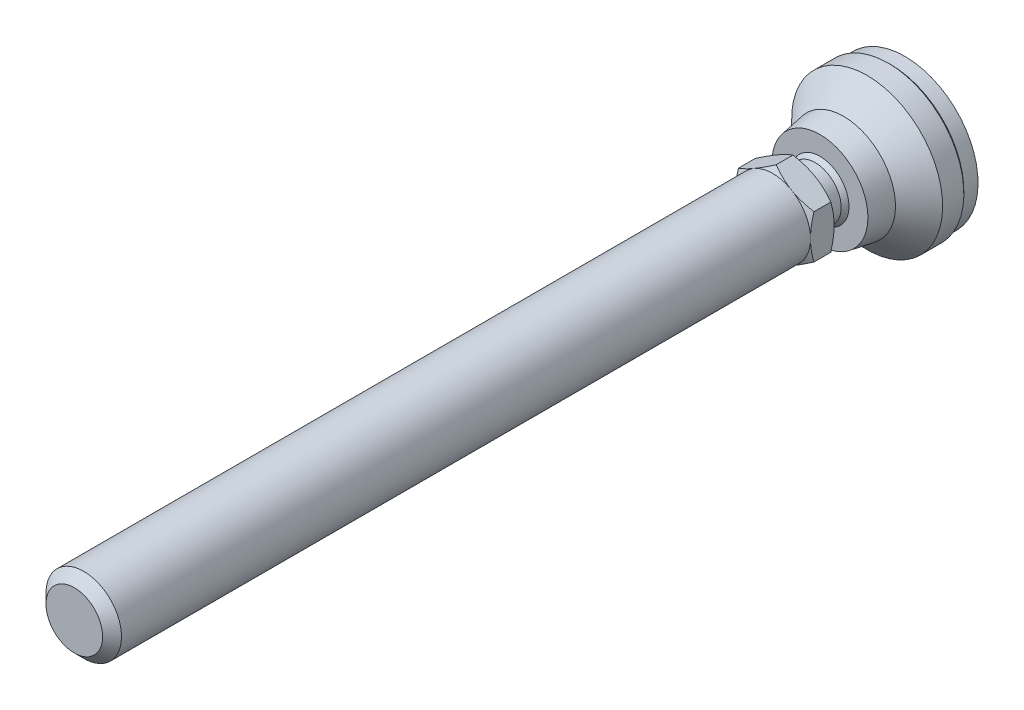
ISO-10303-21;
HEADER;
FILE_DESCRIPTION(('STEP AP214'),'2;1');
FILE_NAME('part.step','',(''),(''),'','','');
FILE_SCHEMA(('AUTOMOTIVE_DESIGN { 1 0 10303 214 1 1 1 1 }'));
ENDSEC;
DATA;
#1=APPLICATION_CONTEXT('core data for automotive mechanical design processes');
#2=APPLICATION_PROTOCOL_DEFINITION('international standard','automotive_design',2000,#1);
#3=PRODUCT_CONTEXT('',#1,'mechanical');
#4=PRODUCT('Part','Part','',(#3));
#5=PRODUCT_RELATED_PRODUCT_CATEGORY('part','',(#4));
#6=PRODUCT_DEFINITION_FORMATION('','',#4);
#7=PRODUCT_DEFINITION_CONTEXT('part definition',#1,'design');
#8=PRODUCT_DEFINITION('design','',#6,#7);
#9=PRODUCT_DEFINITION_SHAPE('','',#8);
#10=(LENGTH_UNIT() NAMED_UNIT(*) SI_UNIT(.MILLI.,.METRE.));
#11=(NAMED_UNIT(*) PLANE_ANGLE_UNIT() SI_UNIT($,.RADIAN.));
#12=(NAMED_UNIT(*) SI_UNIT($,.STERADIAN.) SOLID_ANGLE_UNIT());
#13=UNCERTAINTY_MEASURE_WITH_UNIT(LENGTH_MEASURE(1.E-05),#10,'distance_accuracy_value','');
#14=(GEOMETRIC_REPRESENTATION_CONTEXT(3) GLOBAL_UNCERTAINTY_ASSIGNED_CONTEXT((#13)) GLOBAL_UNIT_ASSIGNED_CONTEXT((#10,
#11,#12)) REPRESENTATION_CONTEXT('',''));
#15=CARTESIAN_POINT('',(0.,0.,0.));
#16=DIRECTION('',(0.,0.,1.));
#17=DIRECTION('',(1.,0.,0.));
#18=AXIS2_PLACEMENT_3D('',#15,#16,#17);
#19=CARTESIAN_POINT('',(-7.7647058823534,0.,23.));
#20=DIRECTION('',(0.,0.,1.));
#21=DIRECTION('',(0.,-1.,0.));
#22=AXIS2_PLACEMENT_3D('',#19,#20,#21);
#23=PLANE('',#22);
#24=CARTESIAN_POINT('',(0.,0.,23.));
#25=DIRECTION('',(0.,0.,-1.));
#26=DIRECTION('',(0.,1.,0.));
#27=AXIS2_PLACEMENT_3D('',#24,#25,#26);
#28=CIRCLE('',#27,5.50000000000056);
#29=CARTESIAN_POINT('',(0.,5.50000000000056,23.));
#30=VERTEX_POINT('',#29);
#31=EDGE_CURVE('E278',#30,#30,#28,.T.);
#32=ORIENTED_EDGE('',*,*,#31,.F.);
#33=EDGE_LOOP('',(#32));
#34=FACE_BOUND('',#33,.T.);
#35=CARTESIAN_POINT('',(0.,0.,23.));
#36=DIRECTION('',(0.,0.,1.));
#37=DIRECTION('',(0.,-1.,0.));
#38=AXIS2_PLACEMENT_3D('',#35,#36,#37);
#39=CIRCLE('',#38,8.);
#40=CARTESIAN_POINT('',(4.,-6.92820323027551,23.));
#41=VERTEX_POINT('',#40);
#42=CARTESIAN_POINT('',(-4.,-6.92820323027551,23.));
#43=VERTEX_POINT('',#42);
#44=EDGE_CURVE('E17',#41,#43,#39,.F.);
#45=ORIENTED_EDGE('',*,*,#44,.T.);
#46=CARTESIAN_POINT('',(-8.,0.,23.));
#47=VERTEX_POINT('',#46);
#48=EDGE_CURVE('E9',#43,#47,#39,.F.);
#49=ORIENTED_EDGE('',*,*,#48,.T.);
#50=CARTESIAN_POINT('',(-4.,6.92820323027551,23.));
#51=VERTEX_POINT('',#50);
#52=EDGE_CURVE('E22',#47,#51,#39,.F.);
#53=ORIENTED_EDGE('',*,*,#52,.T.);
#54=CARTESIAN_POINT('',(4.,6.92820323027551,23.));
#55=VERTEX_POINT('',#54);
#56=EDGE_CURVE('E417',#51,#55,#39,.F.);
#57=ORIENTED_EDGE('',*,*,#56,.T.);
#58=CARTESIAN_POINT('',(8.,0.,23.));
#59=VERTEX_POINT('',#58);
#60=EDGE_CURVE('E120',#55,#59,#39,.F.);
#61=ORIENTED_EDGE('',*,*,#60,.T.);
#62=CARTESIAN_POINT('',(0.,0.,23.));
#63=DIRECTION('',(0.,0.,1.));
#64=DIRECTION('',(0.,-1.,0.));
#65=AXIS2_PLACEMENT_3D('',#62,#63,#64);
#66=CIRCLE('',#65,8.);
#67=EDGE_CURVE('E104',#41,#59,#66,.T.);
#68=ORIENTED_EDGE('',*,*,#67,.F.);
#69=EDGE_LOOP('',(#45,#49,#53,#57,#61,#68));
#70=FACE_BOUND('',#69,.T.);
#71=ADVANCED_FACE('F14',(#34,#70),#23,.F.);
#72=CARTESIAN_POINT('',(0.,0.,3.));
#73=DIRECTION('',(0.,0.,-1.));
#74=DIRECTION('',(0.,1.,0.));
#75=AXIS2_PLACEMENT_3D('',#72,#73,#74);
#76=CYLINDRICAL_SURFACE('',#75,5.50000000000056);
#77=CARTESIAN_POINT('',(0.,0.,18.9999999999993));
#78=DIRECTION('',(0.,0.,-1.));
#79=DIRECTION('',(0.,1.,0.));
#80=AXIS2_PLACEMENT_3D('',#77,#78,#79);
#81=CIRCLE('',#80,5.50000000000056);
#82=CARTESIAN_POINT('',(0.,-5.50000000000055,18.9999999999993));
#83=VERTEX_POINT('',#82);
#84=EDGE_CURVE('E242',#83,#83,#81,.T.);
#85=ORIENTED_EDGE('',*,*,#84,.F.);
#86=EDGE_LOOP('',(#85));
#87=FACE_BOUND('',#86,.T.);
#88=ORIENTED_EDGE('',*,*,#31,.T.);
#89=EDGE_LOOP('',(#88));
#90=FACE_BOUND('',#89,.T.);
#91=ADVANCED_FACE('F346',(#87,#90),#76,.T.);
#92=CARTESIAN_POINT('',(0.,0.,14.6698729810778));
#93=DIRECTION('',(0.,0.,-1.));
#94=DIRECTION('',(0.,-1.,0.));
#95=AXIS2_PLACEMENT_3D('',#92,#93,#94);
#96=SPHERICAL_SURFACE('',#95,7.);
#97=CARTESIAN_POINT('',(0.,0.,18.));
#98=DIRECTION('',(0.,0.,-1.));
#99=DIRECTION('',(0.,1.,0.));
#100=AXIS2_PLACEMENT_3D('',#97,#98,#99);
#101=CIRCLE('',#100,6.15713034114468);
#102=CARTESIAN_POINT('',(0.,-6.15713034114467,18.));
#103=VERTEX_POINT('',#102);
#104=EDGE_CURVE('E246',#103,#103,#101,.T.);
#105=CARTESIAN_POINT('',(0.,-5.50000000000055,18.9999999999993));
#106=CARTESIAN_POINT('',(0.,-5.50771979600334,18.9901945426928));
#107=CARTESIAN_POINT('',(0.,-5.51541336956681,18.9803684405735));
#108=CARTESIAN_POINT('',(0.,-5.53074785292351,18.9606752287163));
#109=CARTESIAN_POINT('',(0.,-5.53838876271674,18.9508081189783));
#110=CARTESIAN_POINT('',(0.,-5.55361769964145,18.9310331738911));
#111=CARTESIAN_POINT('',(0.,-5.56120572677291,18.9211253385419));
#112=CARTESIAN_POINT('',(0.,-5.57632868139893,18.9012692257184));
#113=CARTESIAN_POINT('',(0.,-5.58386360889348,18.8913209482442));
#114=CARTESIAN_POINT('',(0.,-5.59888014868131,18.8713842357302));
#115=CARTESIAN_POINT('',(0.,-5.60636176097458,18.8613958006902));
#116=CARTESIAN_POINT('',(0.,-5.62127145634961,18.8413790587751));
#117=CARTESIAN_POINT('',(0.,-5.62869953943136,18.8313507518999));
#118=CARTESIAN_POINT('',(0.,-5.64350196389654,18.8112545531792));
#119=CARTESIAN_POINT('',(0.,-5.65087630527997,18.8011866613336));
#120=CARTESIAN_POINT('',(0.,-5.66557103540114,18.7810115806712));
#121=CARTESIAN_POINT('',(0.,-5.67289142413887,18.7709043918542));
#122=CARTESIAN_POINT('',(0.,-5.68747803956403,18.7506510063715));
#123=CARTESIAN_POINT('',(0.,-5.69474426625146,18.7405048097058));
#124=CARTESIAN_POINT('',(0.,-5.70922234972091,18.7201736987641));
#125=CARTESIAN_POINT('',(0.,-5.71643420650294,18.7099887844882));
#126=CARTESIAN_POINT('',(0.,-5.73080334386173,18.6895805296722));
#127=CARTESIAN_POINT('',(0.,-5.73796062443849,18.6793571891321));
#128=CARTESIAN_POINT('',(0.,-5.75222040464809,18.6588723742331));
#129=CARTESIAN_POINT('',(0.,-5.75932290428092,18.6486108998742));
#130=CARTESIAN_POINT('',(0.,-5.77347291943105,18.6280501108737));
#131=CARTESIAN_POINT('',(0.,-5.78052043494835,18.6177507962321));
#132=CARTESIAN_POINT('',(0.,-5.79456028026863,18.5971146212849));
#133=CARTESIAN_POINT('',(0.,-5.80155261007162,18.5867777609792));
#134=CARTESIAN_POINT('',(0.,-5.81548188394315,18.5660667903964));
#135=CARTESIAN_POINT('',(0.,-5.82241882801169,18.5556926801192));
#136=CARTESIAN_POINT('',(0.,-5.83623713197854,18.5349075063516));
#137=CARTESIAN_POINT('',(0.,-5.84311849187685,18.5244964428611));
#138=CARTESIAN_POINT('',(0.,-5.85682543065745,18.503637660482));
#139=CARTESIAN_POINT('',(0.,-5.86365100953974,18.4931899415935));
#140=CARTESIAN_POINT('',(0.,-5.8772461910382,18.4722581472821));
#141=CARTESIAN_POINT('',(0.,-5.88401579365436,18.4617740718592));
#142=CARTESIAN_POINT('',(0.,-5.89749882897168,18.440769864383));
#143=CARTESIAN_POINT('',(0.,-5.90421226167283,18.4302497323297));
#144=CARTESIAN_POINT('',(0.,-5.91758276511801,18.4091737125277));
#145=CARTESIAN_POINT('',(0.,-5.92423983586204,18.398617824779));
#146=CARTESIAN_POINT('',(0.,-5.93749742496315,18.3774705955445));
#147=CARTESIAN_POINT('',(0.,-5.94409794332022,18.3668792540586));
#148=CARTESIAN_POINT('',(0.,-5.9572422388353,18.3456614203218));
#149=CARTESIAN_POINT('',(0.,-5.96378601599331,18.3350349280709));
#150=CARTESIAN_POINT('',(0.,-5.97681664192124,18.3137470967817));
#151=CARTESIAN_POINT('',(0.,-5.98330349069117,18.3030857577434));
#152=CARTESIAN_POINT('',(0.,-5.99622007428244,18.2817285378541));
#153=CARTESIAN_POINT('',(0.,-6.00264980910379,18.271032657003));
#154=CARTESIAN_POINT('',(0.,-6.0154519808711,18.2496066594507));
#155=CARTESIAN_POINT('',(0.,-6.02182441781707,18.2388765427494));
#156=CARTESIAN_POINT('',(0.,-6.03451181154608,18.2173823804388));
#157=CARTESIAN_POINT('',(0.,-6.04082676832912,18.2066183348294));
#158=CARTESIAN_POINT('',(0.,-6.05339902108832,18.1850566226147));
#159=CARTESIAN_POINT('',(0.,-6.05965631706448,18.1742589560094));
#160=CARTESIAN_POINT('',(0.,-6.07211306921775,18.1526303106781));
#161=CARTESIAN_POINT('',(0.,-6.07831252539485,18.1417993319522));
#162=CARTESIAN_POINT('',(0.,-6.09065342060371,18.1201043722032));
#163=CARTESIAN_POINT('',(0.,-6.09679485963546,18.1092403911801));
#164=CARTESIAN_POINT('',(0.,-6.10901954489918,18.0874797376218));
#165=CARTESIAN_POINT('',(0.,-6.11510279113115,18.0765830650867));
#166=CARTESIAN_POINT('',(0.,-6.12721091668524,18.0547573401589));
#167=CARTESIAN_POINT('',(0.,-6.13323579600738,18.0438282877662));
#168=CARTESIAN_POINT('',(0.,-6.14522701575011,18.0219381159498));
#169=CARTESIAN_POINT('',(0.,-6.15119335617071,18.010976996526));
#170=CARTESIAN_POINT('',(0.,-6.15713034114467,18.));
#171=B_SPLINE_CURVE_WITH_KNOTS('',3,(#105,#106,#107,#108,#109,#110,#111,#112,#113,#114,#115,
#116,#117,#118,#119,#120,#121,#122,#123,#124,#125,#126,#127,#128,#129,#130,#131,#132,#133,#134,
#135,#136,#137,#138,#139,#140,#141,#142,#143,#144,#145,#146,#147,#148,#149,#150,#151,#152,#153,
#154,#155,#156,#157,#158,#159,#160,#161,#162,#163,#164,#165,#166,#167,#168,#169,#170),
.UNSPECIFIED.,.F.,.F.,(4,2,2,2,2,2,2,2,2,2,2,2,2,2,2,2,2,2,2,2,2,2,2,2,2,2,2,2,2,2,2,2,4),(0.,
0.0374389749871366,0.0748779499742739,0.112316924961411,0.149755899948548,0.187194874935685,
0.224633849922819,0.262072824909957,0.299511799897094,0.336950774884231,0.374389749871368,
0.411828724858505,0.449267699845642,0.486706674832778,0.524145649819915,0.56158462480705,
0.599023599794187,0.636462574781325,0.67390154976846,0.711340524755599,0.748779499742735,
0.786218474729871,0.823657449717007,0.861096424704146,0.898535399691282,0.93597437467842,
0.973413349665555,1.01085232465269,1.04829129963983,1.08573027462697,1.1231692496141,
1.16060822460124,1.19804719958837),.UNSPECIFIED.);
#172=EDGE_CURVE('BSEAM342',#83,#103,#171,.T.);
#173=ORIENTED_EDGE('',*,*,#84,.T.);
#174=ORIENTED_EDGE('',*,*,#104,.F.);
#175=ORIENTED_EDGE('',*,*,#172,.T.);
#176=ORIENTED_EDGE('',*,*,#172,.F.);
#177=EDGE_LOOP('',(#173,#175,#174,#176));
#178=FACE_BOUND('',#177,.T.);
#179=ADVANCED_FACE('F342',(#178),#96,.T.);
#180=CARTESIAN_POINT('',(0.,0.,3.50000000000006));
#181=DIRECTION('',(0.,0.,1.));
#182=DIRECTION('',(0.,-1.,0.));
#183=AXIS2_PLACEMENT_3D('',#180,#181,#182);
#184=CONICAL_SURFACE('',#183,16.,0.785398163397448);
#185=CARTESIAN_POINT('',(0.,0.,3.));
#186=DIRECTION('',(0.,0.,-1.));
#187=DIRECTION('',(0.,1.,0.));
#188=AXIS2_PLACEMENT_3D('',#185,#186,#187);
#189=CIRCLE('',#188,15.5);
#190=CARTESIAN_POINT('',(0.,15.5,3.));
#191=VERTEX_POINT('',#190);
#192=EDGE_CURVE('E267',#191,#191,#189,.T.);
#193=ORIENTED_EDGE('',*,*,#192,.F.);
#194=EDGE_LOOP('',(#193));
#195=FACE_BOUND('',#194,.T.);
#196=CARTESIAN_POINT('',(0.,0.,3.50000000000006));
#197=DIRECTION('',(0.,0.,-1.));
#198=DIRECTION('',(0.,1.,0.));
#199=AXIS2_PLACEMENT_3D('',#196,#197,#198);
#200=CIRCLE('',#199,16.);
#201=CARTESIAN_POINT('',(0.,16.,3.50000000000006));
#202=VERTEX_POINT('',#201);
#203=EDGE_CURVE('E270',#202,#202,#200,.T.);
#204=ORIENTED_EDGE('',*,*,#203,.T.);
#205=EDGE_LOOP('',(#204));
#206=FACE_BOUND('',#205,.T.);
#207=ADVANCED_FACE('F345',(#195,#206),#184,.T.);
#208=CARTESIAN_POINT('',(0.,0.,3.));
#209=DIRECTION('',(0.,0.,-1.));
#210=DIRECTION('',(0.,1.,0.));
#211=AXIS2_PLACEMENT_3D('',#208,#209,#210);
#212=CYLINDRICAL_SURFACE('',#211,16.);
#213=ORIENTED_EDGE('',*,*,#203,.F.);
#214=EDGE_LOOP('',(#213));
#215=FACE_BOUND('',#214,.T.);
#216=CARTESIAN_POINT('',(0.,0.,8.));
#217=DIRECTION('',(0.,0.,-1.));
#218=DIRECTION('',(0.,1.,0.));
#219=AXIS2_PLACEMENT_3D('',#216,#217,#218);
#220=CIRCLE('',#219,16.);
#221=CARTESIAN_POINT('',(0.,16.,8.));
#222=VERTEX_POINT('',#221);
#223=EDGE_CURVE('E273',#222,#222,#220,.T.);
#224=ORIENTED_EDGE('',*,*,#223,.T.);
#225=EDGE_LOOP('',(#224));
#226=FACE_BOUND('',#225,.T.);
#227=ADVANCED_FACE('F385',(#215,#226),#212,.T.);
#228=CARTESIAN_POINT('',(0.,0.,13.));
#229=DIRECTION('',(0.,0.,-1.));
#230=DIRECTION('',(0.,1.,0.));
#231=AXIS2_PLACEMENT_3D('',#228,#229,#230);
#232=CONICAL_SURFACE('',#231,11.,0.785398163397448);
#233=ORIENTED_EDGE('',*,*,#223,.F.);
#234=EDGE_LOOP('',(#233));
#235=FACE_BOUND('',#234,.T.);
#236=CARTESIAN_POINT('',(0.,0.,13.));
#237=DIRECTION('',(0.,0.,-1.));
#238=DIRECTION('',(0.,1.,0.));
#239=AXIS2_PLACEMENT_3D('',#236,#237,#238);
#240=CIRCLE('',#239,11.);
#241=CARTESIAN_POINT('',(0.,11.,13.));
#242=VERTEX_POINT('',#241);
#243=EDGE_CURVE('E276',#242,#242,#240,.T.);
#244=ORIENTED_EDGE('',*,*,#243,.T.);
#245=EDGE_LOOP('',(#244));
#246=FACE_BOUND('',#245,.T.);
#247=ADVANCED_FACE('F381',(#235,#246),#232,.T.);
#248=CARTESIAN_POINT('',(0.,0.,19.));
#249=DIRECTION('',(0.,0.,-1.));
#250=DIRECTION('',(0.,1.,0.));
#251=AXIS2_PLACEMENT_3D('',#248,#249,#250);
#252=CONICAL_SURFACE('',#251,10.,0.165148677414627);
#253=CARTESIAN_POINT('',(0.,0.,18.));
#254=DIRECTION('',(0.,0.,1.));
#255=DIRECTION('',(0.,-1.,0.));
#256=AXIS2_PLACEMENT_3D('',#253,#254,#255);
#257=CIRCLE('',#256,10.1666666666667);
#258=CARTESIAN_POINT('',(0.,-10.1666666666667,18.));
#259=VERTEX_POINT('',#258);
#260=EDGE_CURVE('E249',#259,#259,#257,.T.);
#261=ORIENTED_EDGE('',*,*,#260,.F.);
#262=EDGE_LOOP('',(#261));
#263=FACE_BOUND('',#262,.T.);
#264=ORIENTED_EDGE('',*,*,#243,.F.);
#265=EDGE_LOOP('',(#264));
#266=FACE_BOUND('',#265,.T.);
#267=ADVANCED_FACE('F340',(#263,#266),#252,.T.);
#268=CARTESIAN_POINT('',(-6.60079601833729,0.,18.));
#269=DIRECTION('',(0.,0.,-1.));
#270=DIRECTION('',(0.,1.,0.));
#271=AXIS2_PLACEMENT_3D('',#268,#269,#270);
#272=PLANE('',#271);
#273=ORIENTED_EDGE('',*,*,#260,.T.);
#274=EDGE_LOOP('',(#273));
#275=FACE_BOUND('',#274,.T.);
#276=ORIENTED_EDGE('',*,*,#104,.T.);
#277=EDGE_LOOP('',(#276));
#278=FACE_BOUND('',#277,.T.);
#279=ADVANCED_FACE('F335',(#275,#278),#272,.F.);
#280=CARTESIAN_POINT('',(0.,0.,0.));
#281=DIRECTION('',(0.,0.,1.));
#282=DIRECTION('',(0.,-1.,0.));
#283=AXIS2_PLACEMENT_3D('',#280,#281,#282);
#284=CYLINDRICAL_SURFACE('',#283,15.5);
#285=CARTESIAN_POINT('',(0.,0.,0.));
#286=DIRECTION('',(0.,0.,-1.));
#287=DIRECTION('',(0.,1.,0.));
#288=AXIS2_PLACEMENT_3D('',#285,#286,#287);
#289=CIRCLE('',#288,15.5);
#290=CARTESIAN_POINT('',(0.,15.5,0.));
#291=VERTEX_POINT('',#290);
#292=EDGE_CURVE('E230',#291,#291,#289,.T.);
#293=ORIENTED_EDGE('',*,*,#292,.F.);
#294=EDGE_LOOP('',(#293));
#295=FACE_BOUND('',#294,.T.);
#296=ORIENTED_EDGE('',*,*,#192,.T.);
#297=EDGE_LOOP('',(#296));
#298=FACE_BOUND('',#297,.T.);
#299=ADVANCED_FACE('F339',(#295,#298),#284,.T.);
#300=CARTESIAN_POINT('',(0.,0.,0.));
#301=DIRECTION('',(0.,0.,-1.));
#302=DIRECTION('',(0.,1.,0.));
#303=AXIS2_PLACEMENT_3D('',#300,#301,#302);
#304=PLANE('',#303);
#305=ORIENTED_EDGE('',*,*,#292,.T.);
#306=EDGE_LOOP('',(#305));
#307=FACE_BOUND('',#306,.T.);
#308=ADVANCED_FACE('F358',(#307),#304,.T.);
#309=CARTESIAN_POINT('',(0.,0.,23.));
#310=DIRECTION('',(0.,0.,1.));
#311=DIRECTION('',(0.,-1.,0.));
#312=AXIS2_PLACEMENT_3D('',#309,#310,#311);
#313=CONICAL_SURFACE('',#312,8.,1.0471975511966);
#314=ORIENTED_EDGE('',*,*,#44,.F.);
#315=CARTESIAN_POINT('',(-0.000199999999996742,-9.23771977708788,23.714597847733));
#316=CARTESIAN_POINT('',(0.175648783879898,-9.13619343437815,23.6559907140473));
#317=CARTESIAN_POINT('',(0.352153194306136,-9.03428856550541,23.6000434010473));
#318=CARTESIAN_POINT('',(0.706595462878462,-8.829651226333,23.4942010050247));
#319=CARTESIAN_POINT('',(0.884533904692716,-8.72691841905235,23.4443085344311));
#320=CARTESIAN_POINT('',(1.42119823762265,-8.41707512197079,23.3046927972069));
#321=CARTESIAN_POINT('',(1.78204258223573,-8.20874154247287,23.2252811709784));
#322=CARTESIAN_POINT('',(2.32203917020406,-7.89697436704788,23.1321616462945));
#323=CARTESIAN_POINT('',(2.49957818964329,-7.79447216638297,23.1056345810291));
#324=CARTESIAN_POINT('',(2.85545911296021,-7.5890042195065,23.0611531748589));
#325=CARTESIAN_POINT('',(3.03380094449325,-7.48603851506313,23.0431980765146));
#326=CARTESIAN_POINT('',(3.3907916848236,-7.27992981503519,23.0163156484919));
#327=CARTESIAN_POINT('',(3.56944001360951,-7.17678715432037,23.0073780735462));
#328=CARTESIAN_POINT('',(3.92690170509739,-6.97040655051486,22.9987223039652));
#329=CARTESIAN_POINT('',(4.10571506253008,-6.8671686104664,22.9990038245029));
#330=CARTESIAN_POINT('',(4.44001336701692,-6.67416139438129,23.0081450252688));
#331=CARTESIAN_POINT('',(4.59552190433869,-6.58437849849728,23.0158896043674));
#332=CARTESIAN_POINT('',(4.90617476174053,-6.4050229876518,23.0382011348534));
#333=CARTESIAN_POINT('',(5.06131905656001,-6.31545038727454,23.0527685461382));
#334=CARTESIAN_POINT('',(5.52615131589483,-6.04707935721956,23.1063606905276));
#335=CARTESIAN_POINT('',(5.83501648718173,-5.86875596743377,23.1552686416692));
#336=CARTESIAN_POINT('',(6.45602322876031,-5.5102175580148,23.2775394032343));
#337=CARTESIAN_POINT('',(6.76808554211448,-5.33004829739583,23.351420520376));
#338=CARTESIAN_POINT('',(7.38755648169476,-4.97239658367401,23.519100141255));
#339=CARTESIAN_POINT('',(7.69497304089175,-4.79490955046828,23.6128592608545));
#340=CARTESIAN_POINT('',(8.0002,-4.6186866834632,23.714597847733));
#341=B_SPLINE_CURVE_WITH_KNOTS('',3,(#315,#316,#317,#318,#319,#320,#321,#322,#323,#324,#325,
#326,#327,#328,#329,#330,#331,#332,#333,#334,#335,#336,#337,#338,#339,#340),.UNSPECIFIED.,.F.,
.F.,(4,2,2,2,2,2,2,2,2,2,2,2,4),(0.,0.633973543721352,1.26821965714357,2.53934712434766,
3.1593434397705,3.77928496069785,4.39852133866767,5.01773858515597,5.5568023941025,
6.09590254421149,7.17487077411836,8.27776850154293,9.37850115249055),.UNSPECIFIED.);
#342=CARTESIAN_POINT('',(0.,-9.23760430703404,23.7145311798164));
#343=VERTEX_POINT('',#342);
#344=EDGE_CURVE('E112',#343,#41,#341,.T.);
#345=ORIENTED_EDGE('',*,*,#344,.F.);
#346=CARTESIAN_POINT('',(-8.0002,-4.6186866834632,23.714597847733));
#347=CARTESIAN_POINT('',(-7.82435121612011,-4.72021302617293,23.6559907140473));
#348=CARTESIAN_POINT('',(-7.64784680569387,-4.82211789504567,23.6000434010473));
#349=CARTESIAN_POINT('',(-7.29340453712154,-5.02675523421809,23.4942010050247));
#350=CARTESIAN_POINT('',(-7.11546609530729,-5.12948804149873,23.4443085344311));
#351=CARTESIAN_POINT('',(-6.57880176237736,-5.43933133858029,23.3046927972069));
#352=CARTESIAN_POINT('',(-6.21795741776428,-5.64766491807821,23.2252811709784));
#353=CARTESIAN_POINT('',(-5.67796082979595,-5.9594320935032,23.1321616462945));
#354=CARTESIAN_POINT('',(-5.50042181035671,-6.06193429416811,23.1056345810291));
#355=CARTESIAN_POINT('',(-5.1445408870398,-6.26740224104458,23.0611531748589));
#356=CARTESIAN_POINT('',(-4.96619905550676,-6.37036794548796,23.0431980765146));
#357=CARTESIAN_POINT('',(-4.6092083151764,-6.57647664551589,23.0163156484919));
#358=CARTESIAN_POINT('',(-4.43055998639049,-6.67961930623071,23.0073780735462));
#359=CARTESIAN_POINT('',(-4.07309829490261,-6.88599991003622,22.9987223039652));
#360=CARTESIAN_POINT('',(-3.89428493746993,-6.98923785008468,22.9990038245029));
#361=CARTESIAN_POINT('',(-3.55998663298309,-7.18224506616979,23.0081450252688));
#362=CARTESIAN_POINT('',(-3.40447809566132,-7.2720279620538,23.0158896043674));
#363=CARTESIAN_POINT('',(-3.09382523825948,-7.45138347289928,23.0382011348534));
#364=CARTESIAN_POINT('',(-2.93868094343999,-7.54095607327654,23.0527685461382));
#365=CARTESIAN_POINT('',(-2.47384868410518,-7.80932710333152,23.1063606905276));
#366=CARTESIAN_POINT('',(-2.16498351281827,-7.98765049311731,23.1552686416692));
#367=CARTESIAN_POINT('',(-1.5439767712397,-8.34618890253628,23.2775394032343));
#368=CARTESIAN_POINT('',(-1.23191445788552,-8.52635816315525,23.351420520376));
#369=CARTESIAN_POINT('',(-0.612443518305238,-8.88400987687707,23.519100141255));
#370=CARTESIAN_POINT('',(-0.305026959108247,-9.06149691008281,23.6128592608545));
#371=CARTESIAN_POINT('',(0.000200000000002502,-9.23771977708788,23.714597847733));
#372=B_SPLINE_CURVE_WITH_KNOTS('',3,(#346,#347,#348,#349,#350,#351,#352,#353,#354,#355,#356,
#357,#358,#359,#360,#361,#362,#363,#364,#365,#366,#367,#368,#369,#370,#371),.UNSPECIFIED.,.F.,
.F.,(4,2,2,2,2,2,2,2,2,2,2,2,4),(0.,0.633973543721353,1.26821965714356,2.53934712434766,
3.1593434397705,3.77928496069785,4.39852133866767,5.01773858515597,5.5568023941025,
6.09590254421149,7.17487077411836,8.27776850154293,9.37850115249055),.UNSPECIFIED.);
#373=EDGE_CURVE('E118',#43,#343,#372,.T.);
#374=ORIENTED_EDGE('',*,*,#373,.F.);
#375=EDGE_LOOP('',(#314,#345,#374));
#376=FACE_BOUND('',#375,.T.);
#377=ADVANCED_FACE('F116',(#376),#313,.T.);
#378=ORIENTED_EDGE('',*,*,#67,.T.);
#379=CARTESIAN_POINT('',(8.,12.2996729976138,26.8523637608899));
#380=CARTESIAN_POINT('',(8.,11.951145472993,26.6837297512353));
#381=CARTESIAN_POINT('',(7.99999999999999,11.601806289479,26.5167439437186));
#382=CARTESIAN_POINT('',(7.99999999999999,10.9010725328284,26.1869979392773));
#383=CARTESIAN_POINT('',(7.99999999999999,10.5496776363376,26.0242384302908));
#384=CARTESIAN_POINT('',(7.99999999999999,9.84253794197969,25.7030323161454));
#385=CARTESIAN_POINT('',(7.99999999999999,9.48677980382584,25.544614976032));
#386=CARTESIAN_POINT('',(7.99999999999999,8.772396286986,25.2344078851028));
#387=CARTESIAN_POINT('',(7.99999999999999,8.41377104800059,25.0826178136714));
#388=CARTESIAN_POINT('',(7.99999999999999,7.68192311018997,24.7828475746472));
#389=CARTESIAN_POINT('',(7.99999999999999,7.30859202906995,24.6351305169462));
#390=CARTESIAN_POINT('',(7.99999999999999,6.55752368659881,24.3511375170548));
#391=CARTESIAN_POINT('',(8.,6.17978593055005,24.2148628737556));
#392=CARTESIAN_POINT('',(8.,5.42004106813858,23.9574113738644));
#393=CARTESIAN_POINT('',(7.99999999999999,5.03804475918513,23.8362030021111));
#394=CARTESIAN_POINT('',(8.,4.26858826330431,23.6128419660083));
#395=CARTESIAN_POINT('',(8.,3.88112987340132,23.5106831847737));
#396=CARTESIAN_POINT('',(8.,3.10259616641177,23.3309390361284));
#397=CARTESIAN_POINT('',(8.,2.71155154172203,23.2532243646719));
#398=CARTESIAN_POINT('',(8.,2.12151083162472,23.1584021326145));
#399=CARTESIAN_POINT('',(8.,1.92423628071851,23.1304183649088));
#400=CARTESIAN_POINT('',(8.,1.5287434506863,23.0822519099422));
#401=CARTESIAN_POINT('',(8.,1.33052526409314,23.0620684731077));
#402=CARTESIAN_POINT('',(8.,0.935952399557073,23.0301524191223));
#403=CARTESIAN_POINT('',(8.,0.739606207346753,23.0183152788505));
#404=CARTESIAN_POINT('',(8.,0.346589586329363,23.002946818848));
#405=CARTESIAN_POINT('',(8.,0.149919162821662,22.9994153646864));
#406=CARTESIAN_POINT('',(8.,-0.243395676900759,23.0007422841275));
#407=CARTESIAN_POINT('',(8.,-0.440040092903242,23.0056007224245));
#408=CARTESIAN_POINT('',(8.,-0.832952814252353,23.0235907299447));
#409=CARTESIAN_POINT('',(8.,-1.02922110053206,23.0367227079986));
#410=CARTESIAN_POINT('',(8.,-1.50421339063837,23.0782409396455));
#411=CARTESIAN_POINT('',(8.,-1.78258434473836,23.1107356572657));
#412=CARTESIAN_POINT('',(8.,-2.33719060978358,23.1905723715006));
#413=CARTESIAN_POINT('',(8.,-2.613425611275,23.2379164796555));
#414=CARTESIAN_POINT('',(8.,-3.16352099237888,23.3457675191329));
#415=CARTESIAN_POINT('',(8.,-3.43737927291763,23.4062850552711));
#416=CARTESIAN_POINT('',(8.,-3.98231498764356,23.5386424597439));
#417=CARTESIAN_POINT('',(8.,-4.2533924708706,23.6104821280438));
#418=CARTESIAN_POINT('',(8.,-4.79864339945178,23.7654163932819));
#419=CARTESIAN_POINT('',(8.,-5.07275674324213,23.8487210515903));
#420=CARTESIAN_POINT('',(8.,-5.61828231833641,24.0237048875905));
#421=CARTESIAN_POINT('',(8.,-5.88969453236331,24.11538411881));
#422=CARTESIAN_POINT('',(8.,-6.42995585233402,24.3056819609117));
#423=CARTESIAN_POINT('',(8.,-6.69880583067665,24.4042981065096));
#424=CARTESIAN_POINT('',(8.,-7.2342939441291,24.6073325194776));
#425=CARTESIAN_POINT('',(8.,-7.50093210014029,24.7117507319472));
#426=CARTESIAN_POINT('',(8.,-8.10853475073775,24.9561015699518));
#427=CARTESIAN_POINT('',(8.,-8.44885909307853,25.0976231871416));
#428=CARTESIAN_POINT('',(8.,-9.12678635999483,25.3870574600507));
#429=CARTESIAN_POINT('',(8.,-9.46438914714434,25.5349704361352));
#430=CARTESIAN_POINT('',(8.,-10.1373529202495,25.8359649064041));
#431=CARTESIAN_POINT('',(8.,-10.4727134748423,25.989047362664));
#432=CARTESIAN_POINT('',(8.,-11.1414863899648,26.2993870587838));
#433=CARTESIAN_POINT('',(8.,-11.474898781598,26.4566442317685));
#434=CARTESIAN_POINT('',(8.,-12.1403808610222,26.7747266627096));
#435=CARTESIAN_POINT('',(8.,-12.4724490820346,26.9355549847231));
#436=CARTESIAN_POINT('',(8.,-13.1351924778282,27.2600590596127));
#437=CARTESIAN_POINT('',(8.,-13.4658676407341,27.4237348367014));
#438=CARTESIAN_POINT('',(8.,-14.456137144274,27.918312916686));
#439=CARTESIAN_POINT('',(8.,-15.1139621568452,28.2527595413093));
#440=CARTESIAN_POINT('',(8.,-16.0723226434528,28.7462211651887));
#441=CARTESIAN_POINT('',(8.00000000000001,-16.3742334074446,28.9025817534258));
#442=CARTESIAN_POINT('',(8.00000000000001,-16.9773969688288,29.2165556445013));
#443=CARTESIAN_POINT('',(8.00000000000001,-17.2786497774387,29.3741689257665));
#444=CARTESIAN_POINT('',(8.00000000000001,-18.1815735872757,29.8486498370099));
#445=CARTESIAN_POINT('',(8.00000000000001,-18.7823880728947,30.167147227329));
#446=CARTESIAN_POINT('',(8.00000000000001,-19.9808949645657,30.8067616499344));
#447=CARTESIAN_POINT('',(8.00000000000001,-20.5785913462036,31.1278712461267));
#448=CARTESIAN_POINT('',(8.00000000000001,-21.7725225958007,31.7727267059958));
#449=CARTESIAN_POINT('',(8.00000000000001,-22.3687575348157,32.0964724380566));
#450=CARTESIAN_POINT('',(8.,-22.9644480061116,32.4212105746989));
#451=B_SPLINE_CURVE_WITH_KNOTS('',3,(#379,#380,#381,#382,#383,#384,#385,#386,#387,#388,#389,
#390,#391,#392,#393,#394,#395,#396,#397,#398,#399,#400,#401,#402,#403,#404,#405,#406,#407,#408,
#409,#410,#411,#412,#413,#414,#415,#416,#417,#418,#419,#420,#421,#422,#423,#424,#425,#426,#427,
#428,#429,#430,#431,#432,#433,#434,#435,#436,#437,#438,#439,#440,#441,#442,#443,#444,#445,#446,
#447,#448,#449,#450),.UNSPECIFIED.,.F.,.F.,(4,2,2,2,2,2,2,2,2,2,2,2,2,2,2,2,2,2,2,2,2,2,2,2,2,2,
2,2,2,2,2,2,2,2,2,4),(0.,1.16155669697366,2.32330129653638,3.49155330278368,4.65974872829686,
5.86408151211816,7.06855082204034,8.27045667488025,9.47197592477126,10.6670281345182,
11.26464644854,11.8622073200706,12.4521450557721,13.0420732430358,13.6320059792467,
14.2219678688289,15.0622838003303,15.9027192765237,16.7438338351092,17.5849335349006,
18.444249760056,19.3035714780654,20.1625893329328,21.0215990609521,22.1272437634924,
23.2329439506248,24.3388510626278,25.4447404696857,26.5516184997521,27.6585059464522,
29.8723252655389,30.892318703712,31.9122946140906,33.9523203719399,35.9877916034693,
38.0231618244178),.UNSPECIFIED.);
#452=CARTESIAN_POINT('',(8.,-4.61880215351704,23.7145311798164));
#453=VERTEX_POINT('',#452);
#454=EDGE_CURVE('E107',#453,#59,#451,.F.);
#455=ORIENTED_EDGE('',*,*,#454,.F.);
#456=EDGE_CURVE('E100',#41,#453,#341,.T.);
#457=ORIENTED_EDGE('',*,*,#456,.F.);
#458=EDGE_LOOP('',(#378,#455,#457));
#459=FACE_BOUND('',#458,.T.);
#460=ADVANCED_FACE('F102',(#459),#313,.T.);
#461=ORIENTED_EDGE('',*,*,#60,.F.);
#462=CARTESIAN_POINT('',(8.0002,4.61868668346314,23.7145978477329));
#463=CARTESIAN_POINT('',(7.8243512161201,4.72021302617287,23.6559907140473));
#464=CARTESIAN_POINT('',(7.64784680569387,4.82211789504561,23.6000434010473));
#465=CARTESIAN_POINT('',(7.29340453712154,5.02675523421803,23.4942010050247));
#466=CARTESIAN_POINT('',(7.11546609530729,5.12948804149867,23.4443085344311));
#467=CARTESIAN_POINT('',(6.57880176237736,5.43933133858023,23.3046927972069));
#468=CARTESIAN_POINT('',(6.21795741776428,5.64766491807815,23.2252811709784));
#469=CARTESIAN_POINT('',(5.67796082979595,5.95943209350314,23.1321616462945));
#470=CARTESIAN_POINT('',(5.50042181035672,6.06193429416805,23.1056345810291));
#471=CARTESIAN_POINT('',(5.14454088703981,6.26740224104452,23.0611531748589));
#472=CARTESIAN_POINT('',(4.96619905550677,6.37036794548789,23.0431980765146));
#473=CARTESIAN_POINT('',(4.60920831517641,6.57647664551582,23.0163156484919));
#474=CARTESIAN_POINT('',(4.4305599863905,6.67961930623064,23.0073780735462));
#475=CARTESIAN_POINT('',(4.07309829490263,6.88599991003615,22.9987223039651));
#476=CARTESIAN_POINT('',(3.89428493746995,6.98923785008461,22.9990038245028));
#477=CARTESIAN_POINT('',(3.55998663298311,7.18224506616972,23.0081450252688));
#478=CARTESIAN_POINT('',(3.40447809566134,7.27202796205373,23.0158896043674));
#479=CARTESIAN_POINT('',(3.0938252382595,7.45138347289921,23.0382011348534));
#480=CARTESIAN_POINT('',(2.93868094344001,7.54095607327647,23.0527685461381));
#481=CARTESIAN_POINT('',(2.47384868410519,7.80932710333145,23.1063606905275));
#482=CARTESIAN_POINT('',(2.16498351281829,7.98765049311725,23.1552686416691));
#483=CARTESIAN_POINT('',(1.54397677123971,8.34618890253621,23.2775394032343));
#484=CARTESIAN_POINT('',(1.23191445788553,8.52635816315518,23.351420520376));
#485=CARTESIAN_POINT('',(0.612443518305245,8.88400987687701,23.519100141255));
#486=CARTESIAN_POINT('',(0.305026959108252,9.06149691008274,23.6128592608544));
#487=CARTESIAN_POINT('',(-0.000200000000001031,9.23771977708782,23.7145978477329));
#488=B_SPLINE_CURVE_WITH_KNOTS('',3,(#462,#463,#464,#465,#466,#467,#468,#469,#470,#471,#472,
#473,#474,#475,#476,#477,#478,#479,#480,#481,#482,#483,#484,#485,#486,#487),.UNSPECIFIED.,.F.,
.F.,(4,2,2,2,2,2,2,2,2,2,2,2,4),(0.,0.633973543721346,1.26821965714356,2.53934712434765,
3.15934343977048,3.77928496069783,4.39852133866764,5.01773858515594,5.55680239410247,
6.09590254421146,7.17487077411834,8.27776850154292,9.37850115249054),.UNSPECIFIED.);
#489=CARTESIAN_POINT('',(8.,4.61880215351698,23.7145311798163));
#490=VERTEX_POINT('',#489);
#491=EDGE_CURVE('E187',#490,#55,#488,.T.);
#492=ORIENTED_EDGE('',*,*,#491,.F.);
#493=EDGE_CURVE('E139',#59,#490,#451,.F.);
#494=ORIENTED_EDGE('',*,*,#493,.F.);
#495=EDGE_LOOP('',(#461,#492,#494));
#496=FACE_BOUND('',#495,.T.);
#497=ADVANCED_FACE('F416',(#496),#313,.T.);
#498=ORIENTED_EDGE('',*,*,#56,.F.);
#499=CARTESIAN_POINT('',(0.000199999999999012,9.23771977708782,23.7145978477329));
#500=CARTESIAN_POINT('',(-0.175648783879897,9.13619343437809,23.6559907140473));
#501=CARTESIAN_POINT('',(-0.352153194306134,9.03428856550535,23.6000434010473));
#502=CARTESIAN_POINT('',(-0.706595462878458,8.82965122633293,23.4942010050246));
#503=CARTESIAN_POINT('',(-0.884533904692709,8.72691841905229,23.4443085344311));
#504=CARTESIAN_POINT('',(-1.42119823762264,8.41707512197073,23.3046927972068));
#505=CARTESIAN_POINT('',(-1.78204258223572,8.20874154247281,23.2252811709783));
#506=CARTESIAN_POINT('',(-2.32203917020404,7.89697436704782,23.1321616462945));
#507=CARTESIAN_POINT('',(-2.49957818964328,7.79447216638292,23.1056345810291));
#508=CARTESIAN_POINT('',(-2.85545911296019,7.58900421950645,23.0611531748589));
#509=CARTESIAN_POINT('',(-3.03380094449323,7.48603851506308,23.0431980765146));
#510=CARTESIAN_POINT('',(-3.39079168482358,7.27992981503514,23.0163156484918));
#511=CARTESIAN_POINT('',(-3.56944001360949,7.17678715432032,23.0073780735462));
#512=CARTESIAN_POINT('',(-3.92690170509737,6.97040655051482,22.9987223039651));
#513=CARTESIAN_POINT('',(-4.10571506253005,6.86716861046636,22.9990038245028));
#514=CARTESIAN_POINT('',(-4.44001336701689,6.67416139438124,23.0081450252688));
#515=CARTESIAN_POINT('',(-4.59552190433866,6.58437849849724,23.0158896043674));
#516=CARTESIAN_POINT('',(-4.9061747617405,6.40502298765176,23.0382011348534));
#517=CARTESIAN_POINT('',(-5.06131905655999,6.31545038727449,23.0527685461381));
#518=CARTESIAN_POINT('',(-5.52615131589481,6.04707935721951,23.1063606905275));
#519=CARTESIAN_POINT('',(-5.83501648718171,5.86875596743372,23.1552686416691));
#520=CARTESIAN_POINT('',(-6.45602322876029,5.51021755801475,23.2775394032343));
#521=CARTESIAN_POINT('',(-6.76808554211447,5.33004829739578,23.351420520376));
#522=CARTESIAN_POINT('',(-7.38755648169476,4.97239658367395,23.519100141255));
#523=CARTESIAN_POINT('',(-7.69497304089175,4.79490955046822,23.6128592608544));
#524=CARTESIAN_POINT('',(-8.0002,4.61868668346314,23.7145978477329));
#525=B_SPLINE_CURVE_WITH_KNOTS('',3,(#499,#500,#501,#502,#503,#504,#505,#506,#507,#508,#509,
#510,#511,#512,#513,#514,#515,#516,#517,#518,#519,#520,#521,#522,#523,#524),.UNSPECIFIED.,.F.,
.F.,(4,2,2,2,2,2,2,2,2,2,2,2,4),(0.,0.633973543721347,1.26821965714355,2.53934712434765,
3.15934343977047,3.77928496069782,4.39852133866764,5.01773858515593,5.55680239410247,
6.09590254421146,7.17487077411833,8.27776850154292,9.37850115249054),.UNSPECIFIED.);
#526=CARTESIAN_POINT('',(0.,9.23760430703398,23.7145311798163));
#527=VERTEX_POINT('',#526);
#528=EDGE_CURVE('E188',#527,#51,#525,.T.);
#529=ORIENTED_EDGE('',*,*,#528,.F.);
#530=EDGE_CURVE('E180',#55,#527,#488,.T.);
#531=ORIENTED_EDGE('',*,*,#530,.F.);
#532=EDGE_LOOP('',(#498,#529,#531));
#533=FACE_BOUND('',#532,.T.);
#534=ADVANCED_FACE('F423',(#533),#313,.T.);
#535=ORIENTED_EDGE('',*,*,#52,.F.);
#536=CARTESIAN_POINT('',(-8.,12.2996729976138,26.8523637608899));
#537=CARTESIAN_POINT('',(-8.,11.951145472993,26.6837297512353));
#538=CARTESIAN_POINT('',(-8.,11.601806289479,26.5167439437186));
#539=CARTESIAN_POINT('',(-8.,10.9010725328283,26.1869979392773));
#540=CARTESIAN_POINT('',(-8.,10.5496776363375,26.0242384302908));
#541=CARTESIAN_POINT('',(-8.,9.84253794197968,25.7030323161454));
#542=CARTESIAN_POINT('',(-8.,9.48677980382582,25.544614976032));
#543=CARTESIAN_POINT('',(-8.,8.77239628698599,25.2344078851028));
#544=CARTESIAN_POINT('',(-8.,8.41377104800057,25.0826178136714));
#545=CARTESIAN_POINT('',(-8.,7.68192311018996,24.7828475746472));
#546=CARTESIAN_POINT('',(-8.,7.30859202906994,24.6351305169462));
#547=CARTESIAN_POINT('',(-8.,6.5575236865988,24.3511375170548));
#548=CARTESIAN_POINT('',(-8.,6.17978593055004,24.2148628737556));
#549=CARTESIAN_POINT('',(-8.,5.42004106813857,23.9574113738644));
#550=CARTESIAN_POINT('',(-8.,5.03804475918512,23.8362030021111));
#551=CARTESIAN_POINT('',(-8.,4.26858826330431,23.6128419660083));
#552=CARTESIAN_POINT('',(-8.,3.88112987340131,23.5106831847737));
#553=CARTESIAN_POINT('',(-8.,3.10259616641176,23.3309390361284));
#554=CARTESIAN_POINT('',(-8.,2.71155154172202,23.2532243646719));
#555=CARTESIAN_POINT('',(-8.,2.12151083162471,23.1584021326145));
#556=CARTESIAN_POINT('',(-8.,1.9242362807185,23.1304183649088));
#557=CARTESIAN_POINT('',(-8.,1.52874345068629,23.0822519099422));
#558=CARTESIAN_POINT('',(-8.,1.33052526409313,23.0620684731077));
#559=CARTESIAN_POINT('',(-8.,0.935952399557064,23.0301524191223));
#560=CARTESIAN_POINT('',(-8.,0.739606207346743,23.0183152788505));
#561=CARTESIAN_POINT('',(-8.,0.346589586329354,23.002946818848));
#562=CARTESIAN_POINT('',(-8.,0.149919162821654,22.9994153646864));
#563=CARTESIAN_POINT('',(-8.,-0.243395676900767,23.0007422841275));
#564=CARTESIAN_POINT('',(-8.,-0.44004009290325,23.0056007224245));
#565=CARTESIAN_POINT('',(-8.,-0.832952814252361,23.0235907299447));
#566=CARTESIAN_POINT('',(-8.,-1.02922110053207,23.0367227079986));
#567=CARTESIAN_POINT('',(-8.,-1.50421339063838,23.0782409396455));
#568=CARTESIAN_POINT('',(-8.,-1.78258434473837,23.1107356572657));
#569=CARTESIAN_POINT('',(-8.,-2.33719060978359,23.1905723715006));
#570=CARTESIAN_POINT('',(-8.,-2.61342561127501,23.2379164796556));
#571=CARTESIAN_POINT('',(-8.,-3.16352099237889,23.3457675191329));
#572=CARTESIAN_POINT('',(-8.,-3.43737927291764,23.4062850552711));
#573=CARTESIAN_POINT('',(-8.,-3.98231498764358,23.5386424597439));
#574=CARTESIAN_POINT('',(-8.,-4.25339247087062,23.6104821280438));
#575=CARTESIAN_POINT('',(-8.,-4.7986433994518,23.7654163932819));
#576=CARTESIAN_POINT('',(-8.,-5.07275674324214,23.8487210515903));
#577=CARTESIAN_POINT('',(-8.,-5.61828231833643,24.0237048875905));
#578=CARTESIAN_POINT('',(-8.,-5.88969453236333,24.11538411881));
#579=CARTESIAN_POINT('',(-8.,-6.42995585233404,24.3056819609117));
#580=CARTESIAN_POINT('',(-8.,-6.69880583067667,24.4042981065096));
#581=CARTESIAN_POINT('',(-8.,-7.23429394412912,24.6073325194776));
#582=CARTESIAN_POINT('',(-8.,-7.5009321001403,24.7117507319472));
#583=CARTESIAN_POINT('',(-8.,-8.10853475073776,24.9561015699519));
#584=CARTESIAN_POINT('',(-8.,-8.44885909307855,25.0976231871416));
#585=CARTESIAN_POINT('',(-8.,-9.12678635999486,25.3870574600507));
#586=CARTESIAN_POINT('',(-8.,-9.46438914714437,25.5349704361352));
#587=CARTESIAN_POINT('',(-8.,-10.1373529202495,25.8359649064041));
#588=CARTESIAN_POINT('',(-8.,-10.4727134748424,25.989047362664));
#589=CARTESIAN_POINT('',(-8.,-11.1414863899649,26.2993870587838));
#590=CARTESIAN_POINT('',(-8.,-11.4748987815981,26.4566442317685));
#591=CARTESIAN_POINT('',(-8.,-12.1403808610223,26.7747266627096));
#592=CARTESIAN_POINT('',(-8.,-12.4724490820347,26.9355549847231));
#593=CARTESIAN_POINT('',(-8.,-13.1351924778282,27.2600590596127));
#594=CARTESIAN_POINT('',(-8.,-13.4658676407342,27.4237348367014));
#595=CARTESIAN_POINT('',(-8.,-14.456137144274,27.918312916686));
#596=CARTESIAN_POINT('',(-8.,-15.1139621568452,28.2527595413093));
#597=CARTESIAN_POINT('',(-8.,-16.0723226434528,28.7462211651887));
#598=CARTESIAN_POINT('',(-8.,-16.3742334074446,28.9025817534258));
#599=CARTESIAN_POINT('',(-8.,-16.9773969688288,29.2165556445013));
#600=CARTESIAN_POINT('',(-8.,-17.2786497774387,29.3741689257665));
#601=CARTESIAN_POINT('',(-8.,-18.1815735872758,29.8486498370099));
#602=CARTESIAN_POINT('',(-7.99999999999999,-18.7823880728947,30.167147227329));
#603=CARTESIAN_POINT('',(-7.99999999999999,-19.9808949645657,30.8067616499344));
#604=CARTESIAN_POINT('',(-7.99999999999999,-20.5785913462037,31.1278712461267));
#605=CARTESIAN_POINT('',(-7.99999999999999,-21.7725225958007,31.7727267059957));
#606=CARTESIAN_POINT('',(-8.,-22.3687575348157,32.0964724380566));
#607=CARTESIAN_POINT('',(-8.,-22.9644480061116,32.4212105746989));
#608=B_SPLINE_CURVE_WITH_KNOTS('',3,(#536,#537,#538,#539,#540,#541,#542,#543,#544,#545,#546,
#547,#548,#549,#550,#551,#552,#553,#554,#555,#556,#557,#558,#559,#560,#561,#562,#563,#564,#565,
#566,#567,#568,#569,#570,#571,#572,#573,#574,#575,#576,#577,#578,#579,#580,#581,#582,#583,#584,
#585,#586,#587,#588,#589,#590,#591,#592,#593,#594,#595,#596,#597,#598,#599,#600,#601,#602,#603,
#604,#605,#606,#607),.UNSPECIFIED.,.F.,.F.,(4,2,2,2,2,2,2,2,2,2,2,2,2,2,2,2,2,2,2,2,2,2,2,2,2,2,
2,2,2,2,2,2,2,2,2,4),(0.,1.16155669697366,2.32330129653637,3.49155330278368,4.65974872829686,
5.86408151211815,7.06855082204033,8.27045667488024,9.47197592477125,10.6670281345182,
11.26464644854,11.8622073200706,12.4521450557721,13.0420732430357,13.6320059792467,
14.2219678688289,15.0622838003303,15.9027192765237,16.7438338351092,17.5849335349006,
18.444249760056,19.3035714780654,20.1625893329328,21.0215990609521,22.1272437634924,
23.2329439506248,24.3388510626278,25.4447404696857,26.5516184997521,27.6585059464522,
29.8723252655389,30.892318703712,31.9122946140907,33.9523203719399,35.9877916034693,
38.0231618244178),.UNSPECIFIED.);
#609=CARTESIAN_POINT('',(-8.,4.61880215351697,23.7145311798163));
#610=VERTEX_POINT('',#609);
#611=EDGE_CURVE('E425',#610,#47,#608,.T.);
#612=ORIENTED_EDGE('',*,*,#611,.F.);
#613=EDGE_CURVE('E173',#51,#610,#525,.T.);
#614=ORIENTED_EDGE('',*,*,#613,.F.);
#615=EDGE_LOOP('',(#535,#612,#614));
#616=FACE_BOUND('',#615,.T.);
#617=ADVANCED_FACE('F158',(#616),#313,.T.);
#618=CARTESIAN_POINT('',(-8.,-4.61880215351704,23.7145311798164));
#619=VERTEX_POINT('',#618);
#620=EDGE_CURVE('E124',#47,#619,#608,.T.);
#621=ORIENTED_EDGE('',*,*,#620,.F.);
#622=ORIENTED_EDGE('',*,*,#48,.F.);
#623=EDGE_CURVE('E31',#619,#43,#372,.T.);
#624=ORIENTED_EDGE('',*,*,#623,.F.);
#625=EDGE_LOOP('',(#621,#622,#624));
#626=FACE_BOUND('',#625,.T.);
#627=ADVANCED_FACE('F153',(#626),#313,.T.);
#628=CARTESIAN_POINT('',(0.,0.,176.));
#629=DIRECTION('',(0.,0.,-1.));
#630=DIRECTION('',(0.,1.,0.));
#631=AXIS2_PLACEMENT_3D('',#628,#629,#630);
#632=PLANE('',#631);
#633=CARTESIAN_POINT('',(0.,0.,176.));
#634=DIRECTION('',(0.,0.,-1.));
#635=DIRECTION('',(0.,1.,0.));
#636=AXIS2_PLACEMENT_3D('',#633,#634,#635);
#637=CIRCLE('',#636,6.);
#638=CARTESIAN_POINT('',(0.,6.,176.));
#639=VERTEX_POINT('',#638);
#640=EDGE_CURVE('E233',#639,#639,#637,.T.);
#641=ORIENTED_EDGE('',*,*,#640,.F.);
#642=EDGE_LOOP('',(#641));
#643=FACE_BOUND('',#642,.T.);
#644=ADVANCED_FACE('F157',(#643),#632,.F.);
#645=CARTESIAN_POINT('',(0.,0.,176.));
#646=DIRECTION('',(0.,0.,-1.));
#647=DIRECTION('',(0.,1.,0.));
#648=AXIS2_PLACEMENT_3D('',#645,#646,#647);
#649=CONICAL_SURFACE('',#648,6.,0.785398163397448);
#650=CARTESIAN_POINT('',(0.,0.,174.));
#651=DIRECTION('',(0.,0.,-1.));
#652=DIRECTION('',(0.,1.,0.));
#653=AXIS2_PLACEMENT_3D('',#650,#651,#652);
#654=CIRCLE('',#653,8.);
#655=CARTESIAN_POINT('',(0.,8.,174.));
#656=VERTEX_POINT('',#655);
#657=EDGE_CURVE('E236',#656,#656,#654,.T.);
#658=ORIENTED_EDGE('',*,*,#657,.F.);
#659=EDGE_LOOP('',(#658));
#660=FACE_BOUND('',#659,.T.);
#661=ORIENTED_EDGE('',*,*,#640,.T.);
#662=EDGE_LOOP('',(#661));
#663=FACE_BOUND('',#662,.T.);
#664=ADVANCED_FACE('F350',(#660,#663),#649,.T.);
#665=CARTESIAN_POINT('',(0.,0.,0.315228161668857));
#666=DIRECTION('',(0.,0.,-1.));
#667=DIRECTION('',(0.,1.,0.));
#668=AXIS2_PLACEMENT_3D('',#665,#666,#667);
#669=CYLINDRICAL_SURFACE('',#668,8.);
#670=CARTESIAN_POINT('',(0.,0.,28.));
#671=DIRECTION('',(0.,0.,-1.));
#672=DIRECTION('',(0.,1.,0.));
#673=AXIS2_PLACEMENT_3D('',#670,#671,#672);
#674=CIRCLE('',#673,8.);
#675=CARTESIAN_POINT('',(4.,6.92820323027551,28.));
#676=VERTEX_POINT('',#675);
#677=CARTESIAN_POINT('',(8.,0.,28.));
#678=VERTEX_POINT('',#677);
#679=EDGE_CURVE('E239',#676,#678,#674,.T.);
#680=ORIENTED_EDGE('',*,*,#679,.F.);
#681=CARTESIAN_POINT('',(-4.,6.92820323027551,28.));
#682=VERTEX_POINT('',#681);
#683=EDGE_CURVE('E243',#682,#676,#674,.T.);
#684=ORIENTED_EDGE('',*,*,#683,.F.);
#685=CARTESIAN_POINT('',(-8.,0.,28.));
#686=VERTEX_POINT('',#685);
#687=EDGE_CURVE('E283',#686,#682,#674,.T.);
#688=ORIENTED_EDGE('',*,*,#687,.F.);
#689=CARTESIAN_POINT('',(-4.,-6.92820323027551,28.));
#690=VERTEX_POINT('',#689);
#691=EDGE_CURVE('E288',#690,#686,#674,.T.);
#692=ORIENTED_EDGE('',*,*,#691,.F.);
#693=CARTESIAN_POINT('',(4.,-6.92820323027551,28.));
#694=VERTEX_POINT('',#693);
#695=EDGE_CURVE('E121',#694,#690,#674,.T.);
#696=ORIENTED_EDGE('',*,*,#695,.F.);
#697=CARTESIAN_POINT('',(0.,0.,28.));
#698=DIRECTION('',(0.,0.,1.));
#699=DIRECTION('',(0.,-1.,0.));
#700=AXIS2_PLACEMENT_3D('',#697,#698,#699);
#701=CIRCLE('',#700,8.);
#702=EDGE_CURVE('E328',#694,#678,#701,.T.);
#703=ORIENTED_EDGE('',*,*,#702,.T.);
#704=EDGE_LOOP('',(#680,#684,#688,#692,#696,#703));
#705=FACE_BOUND('',#704,.T.);
#706=ORIENTED_EDGE('',*,*,#657,.T.);
#707=EDGE_LOOP('',(#706));
#708=FACE_BOUND('',#707,.T.);
#709=ADVANCED_FACE('F304',(#705,#708),#669,.T.);
#710=CARTESIAN_POINT('',(0.,0.,26.9260022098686));
#711=DIRECTION('',(0.,0.,-1.));
#712=DIRECTION('',(0.,1.,0.));
#713=AXIS2_PLACEMENT_3D('',#710,#711,#712);
#714=CONICAL_SURFACE('',#713,9.86021873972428,1.0471975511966);
#715=ORIENTED_EDGE('',*,*,#695,.T.);
#716=CARTESIAN_POINT('',(0.000200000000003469,-9.23771977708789,27.285402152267));
#717=CARTESIAN_POINT('',(-0.175648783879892,-9.13619343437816,27.3440092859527));
#718=CARTESIAN_POINT('',(-0.352153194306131,-9.03428856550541,27.3999565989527));
#719=CARTESIAN_POINT('',(-0.706595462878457,-8.829651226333,27.5057989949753));
#720=CARTESIAN_POINT('',(-0.88453390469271,-8.72691841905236,27.5556914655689));
#721=CARTESIAN_POINT('',(-1.42119823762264,-8.41707512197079,27.6953072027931));
#722=CARTESIAN_POINT('',(-1.78204258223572,-8.20874154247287,27.7747188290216));
#723=CARTESIAN_POINT('',(-2.32203917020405,-7.89697436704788,27.8678383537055));
#724=CARTESIAN_POINT('',(-2.49957818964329,-7.79447216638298,27.8943654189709));
#725=CARTESIAN_POINT('',(-2.8554591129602,-7.5890042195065,27.9388468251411));
#726=CARTESIAN_POINT('',(-3.03380094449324,-7.48603851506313,27.9568019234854));
#727=CARTESIAN_POINT('',(-3.3907916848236,-7.2799298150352,27.9836843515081));
#728=CARTESIAN_POINT('',(-3.56944001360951,-7.17678715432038,27.9926219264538));
#729=CARTESIAN_POINT('',(-3.92690170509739,-6.97040655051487,28.0012776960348));
#730=CARTESIAN_POINT('',(-4.10571506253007,-6.86716861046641,28.0009961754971));
#731=CARTESIAN_POINT('',(-4.44001336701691,-6.6741613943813,27.9918549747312));
#732=CARTESIAN_POINT('',(-4.59552190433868,-6.58437849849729,27.9841103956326));
#733=CARTESIAN_POINT('',(-4.90617476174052,-6.40502298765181,27.9617988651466));
#734=CARTESIAN_POINT('',(-5.06131905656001,-6.31545038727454,27.9472314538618));
#735=CARTESIAN_POINT('',(-5.52615131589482,-6.04707935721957,27.8936393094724));
#736=CARTESIAN_POINT('',(-5.83501648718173,-5.86875596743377,27.8447313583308));
#737=CARTESIAN_POINT('',(-6.4560232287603,-5.51021755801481,27.7224605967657));
#738=CARTESIAN_POINT('',(-6.76808554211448,-5.33004829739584,27.648579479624));
#739=CARTESIAN_POINT('',(-7.38755648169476,-4.97239658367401,27.480899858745));
#740=CARTESIAN_POINT('',(-7.69497304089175,-4.79490955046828,27.3871407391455));
#741=CARTESIAN_POINT('',(-8.0002,-4.6186866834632,27.285402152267));
#742=B_SPLINE_CURVE_WITH_KNOTS('',3,(#716,#717,#718,#719,#720,#721,#722,#723,#724,#725,#726,
#727,#728,#729,#730,#731,#732,#733,#734,#735,#736,#737,#738,#739,#740,#741),.UNSPECIFIED.,.F.,
.F.,(4,2,2,2,2,2,2,2,2,2,2,2,4),(0.,0.633973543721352,1.26821965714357,2.53934712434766,
3.1593434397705,3.77928496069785,4.39852133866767,5.01773858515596,5.5568023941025,
6.09590254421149,7.17487077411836,8.27776850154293,9.37850115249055),.UNSPECIFIED.);
#743=CARTESIAN_POINT('',(0.,-9.23760430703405,27.2854688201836));
#744=VERTEX_POINT('',#743);
#745=EDGE_CURVE('E300',#744,#690,#742,.T.);
#746=ORIENTED_EDGE('',*,*,#745,.F.);
#747=CARTESIAN_POINT('',(8.0002,-4.6186866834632,27.285402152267));
#748=CARTESIAN_POINT('',(7.8243512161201,-4.72021302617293,27.3440092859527));
#749=CARTESIAN_POINT('',(7.64784680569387,-4.82211789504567,27.3999565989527));
#750=CARTESIAN_POINT('',(7.29340453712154,-5.02675523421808,27.5057989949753));
#751=CARTESIAN_POINT('',(7.11546609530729,-5.12948804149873,27.5556914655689));
#752=CARTESIAN_POINT('',(6.57880176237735,-5.43933133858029,27.6953072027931));
#753=CARTESIAN_POINT('',(6.21795741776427,-5.64766491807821,27.7747188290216));
#754=CARTESIAN_POINT('',(5.67796082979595,-5.9594320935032,27.8678383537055));
#755=CARTESIAN_POINT('',(5.50042181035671,-6.06193429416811,27.8943654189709));
#756=CARTESIAN_POINT('',(5.1445408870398,-6.26740224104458,27.9388468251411));
#757=CARTESIAN_POINT('',(4.96619905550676,-6.37036794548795,27.9568019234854));
#758=CARTESIAN_POINT('',(4.6092083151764,-6.57647664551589,27.9836843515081));
#759=CARTESIAN_POINT('',(4.4305599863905,-6.67961930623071,27.9926219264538));
#760=CARTESIAN_POINT('',(4.07309829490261,-6.88599991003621,28.0012776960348));
#761=CARTESIAN_POINT('',(3.89428493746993,-6.98923785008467,28.0009961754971));
#762=CARTESIAN_POINT('',(3.55998663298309,-7.18224506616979,27.9918549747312));
#763=CARTESIAN_POINT('',(3.40447809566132,-7.27202796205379,27.9841103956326));
#764=CARTESIAN_POINT('',(3.09382523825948,-7.45138347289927,27.9617988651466));
#765=CARTESIAN_POINT('',(2.93868094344,-7.54095607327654,27.9472314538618));
#766=CARTESIAN_POINT('',(2.47384868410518,-7.80932710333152,27.8936393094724));
#767=CARTESIAN_POINT('',(2.16498351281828,-7.98765049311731,27.8447313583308));
#768=CARTESIAN_POINT('',(1.5439767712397,-8.34618890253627,27.7224605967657));
#769=CARTESIAN_POINT('',(1.23191445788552,-8.52635816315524,27.648579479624));
#770=CARTESIAN_POINT('',(0.612443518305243,-8.88400987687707,27.480899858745));
#771=CARTESIAN_POINT('',(0.305026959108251,-9.0614969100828,27.3871407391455));
#772=CARTESIAN_POINT('',(-0.000199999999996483,-9.23771977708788,27.285402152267));
#773=B_SPLINE_CURVE_WITH_KNOTS('',3,(#747,#748,#749,#750,#751,#752,#753,#754,#755,#756,#757,
#758,#759,#760,#761,#762,#763,#764,#765,#766,#767,#768,#769,#770,#771,#772),.UNSPECIFIED.,.F.,
.F.,(4,2,2,2,2,2,2,2,2,2,2,2,4),(0.,0.633973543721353,1.26821965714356,2.53934712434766,
3.15934343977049,3.77928496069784,4.39852133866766,5.01773858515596,5.55680239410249,
6.09590254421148,7.17487077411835,8.27776850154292,9.37850115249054),.UNSPECIFIED.);
#774=EDGE_CURVE('E207',#694,#744,#773,.T.);
#775=ORIENTED_EDGE('',*,*,#774,.F.);
#776=EDGE_LOOP('',(#715,#746,#775));
#777=FACE_BOUND('',#776,.T.);
#778=ADVANCED_FACE('F298',(#777),#714,.T.);
#779=ORIENTED_EDGE('',*,*,#702,.F.);
#780=CARTESIAN_POINT('',(8.,-4.61880215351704,27.2854688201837));
#781=VERTEX_POINT('',#780);
#782=EDGE_CURVE('E221',#781,#694,#773,.T.);
#783=ORIENTED_EDGE('',*,*,#782,.F.);
#784=CARTESIAN_POINT('',(8.,12.2996729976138,24.1476362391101));
#785=CARTESIAN_POINT('',(8.,11.951145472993,24.3162702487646));
#786=CARTESIAN_POINT('',(7.99999999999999,11.601806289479,24.4832560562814));
#787=CARTESIAN_POINT('',(7.99999999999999,10.9010725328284,24.8130020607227));
#788=CARTESIAN_POINT('',(7.99999999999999,10.5496776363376,24.9757615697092));
#789=CARTESIAN_POINT('',(7.99999999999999,9.8425379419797,25.2969676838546));
#790=CARTESIAN_POINT('',(7.99999999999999,9.48677980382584,25.455385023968));
#791=CARTESIAN_POINT('',(7.99999999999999,8.772396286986,25.7655921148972));
#792=CARTESIAN_POINT('',(7.99999999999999,8.41377104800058,25.9173821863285));
#793=CARTESIAN_POINT('',(7.99999999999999,7.68192311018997,26.2171524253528));
#794=CARTESIAN_POINT('',(7.99999999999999,7.30859202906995,26.3648694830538));
#795=CARTESIAN_POINT('',(7.99999999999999,6.55752368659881,26.6488624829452));
#796=CARTESIAN_POINT('',(8.,6.17978593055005,26.7851371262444));
#797=CARTESIAN_POINT('',(8.,5.42004106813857,27.0425886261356));
#798=CARTESIAN_POINT('',(7.99999999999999,5.03804475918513,27.1637969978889));
#799=CARTESIAN_POINT('',(8.,4.26858826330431,27.3871580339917));
#800=CARTESIAN_POINT('',(8.,3.88112987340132,27.4893168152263));
#801=CARTESIAN_POINT('',(8.,3.10259616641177,27.6690609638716));
#802=CARTESIAN_POINT('',(8.,2.71155154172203,27.7467756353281));
#803=CARTESIAN_POINT('',(8.,2.12151083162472,27.8415978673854));
#804=CARTESIAN_POINT('',(8.,1.92423628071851,27.8695816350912));
#805=CARTESIAN_POINT('',(8.,1.5287434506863,27.9177480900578));
#806=CARTESIAN_POINT('',(8.,1.33052526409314,27.9379315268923));
#807=CARTESIAN_POINT('',(8.,0.935952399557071,27.9698475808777));
#808=CARTESIAN_POINT('',(8.,0.739606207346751,27.9816847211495));
#809=CARTESIAN_POINT('',(8.,0.346589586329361,27.997053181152));
#810=CARTESIAN_POINT('',(8.,0.14991916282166,28.0005846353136));
#811=CARTESIAN_POINT('',(8.,-0.24339567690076,27.9992577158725));
#812=CARTESIAN_POINT('',(8.,-0.440040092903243,27.9943992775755));
#813=CARTESIAN_POINT('',(8.,-0.832952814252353,27.9764092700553));
#814=CARTESIAN_POINT('',(8.,-1.02922110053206,27.9632772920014));
#815=CARTESIAN_POINT('',(8.,-1.50421339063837,27.9217590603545));
#816=CARTESIAN_POINT('',(8.,-1.78258434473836,27.8892643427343));
#817=CARTESIAN_POINT('',(8.,-2.33719060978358,27.8094276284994));
#818=CARTESIAN_POINT('',(8.,-2.613425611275,27.7620835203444));
#819=CARTESIAN_POINT('',(8.,-3.16352099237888,27.6542324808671));
#820=CARTESIAN_POINT('',(8.,-3.43737927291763,27.5937149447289));
#821=CARTESIAN_POINT('',(8.,-3.98231498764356,27.4613575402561));
#822=CARTESIAN_POINT('',(8.,-4.2533924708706,27.3895178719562));
#823=CARTESIAN_POINT('',(8.,-4.79864339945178,27.2345836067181));
#824=CARTESIAN_POINT('',(8.,-5.07275674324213,27.1512789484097));
#825=CARTESIAN_POINT('',(8.,-5.61828231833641,26.9762951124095));
#826=CARTESIAN_POINT('',(8.,-5.88969453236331,26.88461588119));
#827=CARTESIAN_POINT('',(8.,-6.42995585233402,26.6943180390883));
#828=CARTESIAN_POINT('',(8.,-6.69880583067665,26.5957018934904));
#829=CARTESIAN_POINT('',(8.,-7.2342939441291,26.3926674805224));
#830=CARTESIAN_POINT('',(8.,-7.50093210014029,26.2882492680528));
#831=CARTESIAN_POINT('',(8.,-8.10853475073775,26.0438984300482));
#832=CARTESIAN_POINT('',(8.,-8.44885909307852,25.9023768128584));
#833=CARTESIAN_POINT('',(8.,-9.12678635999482,25.6129425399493));
#834=CARTESIAN_POINT('',(8.,-9.46438914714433,25.4650295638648));
#835=CARTESIAN_POINT('',(8.,-10.1373529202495,25.1640350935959));
#836=CARTESIAN_POINT('',(8.,-10.4727134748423,25.010952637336));
#837=CARTESIAN_POINT('',(8.,-11.1414863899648,24.7006129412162));
#838=CARTESIAN_POINT('',(8.,-11.474898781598,24.5433557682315));
#839=CARTESIAN_POINT('',(8.,-12.1403808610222,24.2252733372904));
#840=CARTESIAN_POINT('',(8.,-12.4724490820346,24.0644450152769));
#841=CARTESIAN_POINT('',(8.,-13.1351924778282,23.7399409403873));
#842=CARTESIAN_POINT('',(8.,-13.4658676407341,23.5762651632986));
#843=CARTESIAN_POINT('',(8.,-14.456137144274,23.081687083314));
#844=CARTESIAN_POINT('',(8.,-15.1139621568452,22.7472404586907));
#845=CARTESIAN_POINT('',(8.,-16.0723226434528,22.2537788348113));
#846=CARTESIAN_POINT('',(8.00000000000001,-16.3742334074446,22.0974182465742));
#847=CARTESIAN_POINT('',(8.00000000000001,-16.9773969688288,21.7834443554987));
#848=CARTESIAN_POINT('',(8.00000000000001,-17.2786497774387,21.6258310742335));
#849=CARTESIAN_POINT('',(8.00000000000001,-18.1815735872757,21.1513501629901));
#850=CARTESIAN_POINT('',(8.00000000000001,-18.7823880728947,20.832852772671));
#851=CARTESIAN_POINT('',(8.00000000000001,-19.9808949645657,20.1932383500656));
#852=CARTESIAN_POINT('',(8.00000000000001,-20.5785913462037,19.8721287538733));
#853=CARTESIAN_POINT('',(8.00000000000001,-21.7725225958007,19.2272732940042));
#854=CARTESIAN_POINT('',(8.00000000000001,-22.3687575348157,18.9035275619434));
#855=CARTESIAN_POINT('',(8.,-22.9644480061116,18.5787894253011));
#856=B_SPLINE_CURVE_WITH_KNOTS('',3,(#784,#785,#786,#787,#788,#789,#790,#791,#792,#793,#794,
#795,#796,#797,#798,#799,#800,#801,#802,#803,#804,#805,#806,#807,#808,#809,#810,#811,#812,#813,
#814,#815,#816,#817,#818,#819,#820,#821,#822,#823,#824,#825,#826,#827,#828,#829,#830,#831,#832,
#833,#834,#835,#836,#837,#838,#839,#840,#841,#842,#843,#844,#845,#846,#847,#848,#849,#850,#851,
#852,#853,#854,#855),.UNSPECIFIED.,.F.,.F.,(4,2,2,2,2,2,2,2,2,2,2,2,2,2,2,2,2,2,2,2,2,2,2,2,2,2,
2,2,2,2,2,2,2,2,2,4),(0.,1.16155669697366,2.32330129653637,3.49155330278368,4.65974872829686,
5.86408151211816,7.06855082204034,8.27045667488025,9.47197592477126,10.6670281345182,
11.26464644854,11.8622073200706,12.4521450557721,13.0420732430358,13.6320059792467,
14.2219678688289,15.0622838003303,15.9027192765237,16.7438338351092,17.5849335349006,
18.444249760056,19.3035714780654,20.1625893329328,21.0215990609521,22.1272437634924,
23.2329439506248,24.3388510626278,25.4447404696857,26.5516184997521,27.6585059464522,
29.8723252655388,30.892318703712,31.9122946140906,33.9523203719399,35.9877916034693,
38.0231618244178),.UNSPECIFIED.);
#857=EDGE_CURVE('E222',#678,#781,#856,.T.);
#858=ORIENTED_EDGE('',*,*,#857,.F.);
#859=EDGE_LOOP('',(#779,#783,#858));
#860=FACE_BOUND('',#859,.T.);
#861=ADVANCED_FACE('F427',(#860),#714,.T.);
#862=CARTESIAN_POINT('',(-0.000200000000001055,9.23771977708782,27.2854021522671));
#863=CARTESIAN_POINT('',(0.175648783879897,9.13619343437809,27.3440092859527));
#864=CARTESIAN_POINT('',(0.352153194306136,9.03428856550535,27.3999565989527));
#865=CARTESIAN_POINT('',(0.70659546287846,8.82965122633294,27.5057989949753));
#866=CARTESIAN_POINT('',(0.884533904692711,8.7269184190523,27.5556914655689));
#867=CARTESIAN_POINT('',(1.42119823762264,8.41707512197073,27.6953072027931));
#868=CARTESIAN_POINT('',(1.78204258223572,8.20874154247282,27.7747188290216));
#869=CARTESIAN_POINT('',(2.32203917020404,7.89697436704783,27.8678383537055));
#870=CARTESIAN_POINT('',(2.49957818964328,7.79447216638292,27.8943654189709));
#871=CARTESIAN_POINT('',(2.85545911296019,7.58900421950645,27.9388468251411));
#872=CARTESIAN_POINT('',(3.03380094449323,7.48603851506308,27.9568019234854));
#873=CARTESIAN_POINT('',(3.39079168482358,7.27992981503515,27.9836843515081));
#874=CARTESIAN_POINT('',(3.56944001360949,7.17678715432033,27.9926219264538));
#875=CARTESIAN_POINT('',(3.92690170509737,6.97040655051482,28.0012776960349));
#876=CARTESIAN_POINT('',(4.10571506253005,6.86716861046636,28.0009961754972));
#877=CARTESIAN_POINT('',(4.44001336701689,6.67416139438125,27.9918549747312));
#878=CARTESIAN_POINT('',(4.59552190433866,6.58437849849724,27.9841103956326));
#879=CARTESIAN_POINT('',(4.9061747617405,6.40502298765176,27.9617988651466));
#880=CARTESIAN_POINT('',(5.06131905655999,6.3154503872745,27.9472314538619));
#881=CARTESIAN_POINT('',(5.52615131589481,6.04707935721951,27.8936393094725));
#882=CARTESIAN_POINT('',(5.83501648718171,5.86875596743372,27.8447313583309));
#883=CARTESIAN_POINT('',(6.45602322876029,5.51021755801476,27.7224605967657));
#884=CARTESIAN_POINT('',(6.76808554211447,5.33004829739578,27.648579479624));
#885=CARTESIAN_POINT('',(7.38755648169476,4.97239658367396,27.480899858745));
#886=CARTESIAN_POINT('',(7.69497304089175,4.79490955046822,27.3871407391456));
#887=CARTESIAN_POINT('',(8.0002,4.61868668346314,27.2854021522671));
#888=B_SPLINE_CURVE_WITH_KNOTS('',3,(#862,#863,#864,#865,#866,#867,#868,#869,#870,#871,#872,
#873,#874,#875,#876,#877,#878,#879,#880,#881,#882,#883,#884,#885,#886,#887),.UNSPECIFIED.,.F.,
.F.,(4,2,2,2,2,2,2,2,2,2,2,2,4),(0.,0.633973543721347,1.26821965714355,2.53934712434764,
3.15934343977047,3.77928496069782,4.39852133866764,5.01773858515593,5.55680239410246,
6.09590254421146,7.17487077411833,8.27776850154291,9.37850115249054),.UNSPECIFIED.);
#889=CARTESIAN_POINT('',(8.,4.61880215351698,27.2854688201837));
#890=VERTEX_POINT('',#889);
#891=EDGE_CURVE('E209',#676,#890,#888,.T.);
#892=ORIENTED_EDGE('',*,*,#891,.F.);
#893=ORIENTED_EDGE('',*,*,#679,.T.);
#894=EDGE_CURVE('E229',#890,#678,#856,.T.);
#895=ORIENTED_EDGE('',*,*,#894,.F.);
#896=EDGE_LOOP('',(#892,#893,#895));
#897=FACE_BOUND('',#896,.T.);
#898=ADVANCED_FACE('F159',(#897),#714,.T.);
#899=CARTESIAN_POINT('',(-8.0002,4.61868668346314,27.2854021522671));
#900=CARTESIAN_POINT('',(-7.8243512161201,4.72021302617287,27.3440092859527));
#901=CARTESIAN_POINT('',(-7.64784680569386,4.82211789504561,27.3999565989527));
#902=CARTESIAN_POINT('',(-7.29340453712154,5.02675523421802,27.5057989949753));
#903=CARTESIAN_POINT('',(-7.11546609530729,5.12948804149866,27.5556914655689));
#904=CARTESIAN_POINT('',(-6.57880176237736,5.43933133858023,27.6953072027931));
#905=CARTESIAN_POINT('',(-6.21795741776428,5.64766491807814,27.7747188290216));
#906=CARTESIAN_POINT('',(-5.67796082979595,5.95943209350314,27.8678383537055));
#907=CARTESIAN_POINT('',(-5.50042181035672,6.06193429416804,27.8943654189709));
#908=CARTESIAN_POINT('',(-5.14454088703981,6.26740224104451,27.9388468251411));
#909=CARTESIAN_POINT('',(-4.96619905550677,6.37036794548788,27.9568019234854));
#910=CARTESIAN_POINT('',(-4.60920831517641,6.57647664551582,27.9836843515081));
#911=CARTESIAN_POINT('',(-4.43055998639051,6.67961930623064,27.9926219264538));
#912=CARTESIAN_POINT('',(-4.07309829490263,6.88599991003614,28.0012776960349));
#913=CARTESIAN_POINT('',(-3.89428493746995,6.9892378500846,28.0009961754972));
#914=CARTESIAN_POINT('',(-3.55998663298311,7.18224506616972,27.9918549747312));
#915=CARTESIAN_POINT('',(-3.40447809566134,7.27202796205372,27.9841103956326));
#916=CARTESIAN_POINT('',(-3.0938252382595,7.4513834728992,27.9617988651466));
#917=CARTESIAN_POINT('',(-2.93868094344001,7.54095607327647,27.9472314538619));
#918=CARTESIAN_POINT('',(-2.47384868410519,7.80932710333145,27.8936393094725));
#919=CARTESIAN_POINT('',(-2.16498351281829,7.98765049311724,27.8447313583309));
#920=CARTESIAN_POINT('',(-1.54397677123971,8.34618890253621,27.7224605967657));
#921=CARTESIAN_POINT('',(-1.23191445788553,8.52635816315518,27.648579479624));
#922=CARTESIAN_POINT('',(-0.612443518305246,8.88400987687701,27.480899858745));
#923=CARTESIAN_POINT('',(-0.305026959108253,9.06149691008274,27.3871407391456));
#924=CARTESIAN_POINT('',(0.00019999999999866,9.23771977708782,27.2854021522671));
#925=B_SPLINE_CURVE_WITH_KNOTS('',3,(#899,#900,#901,#902,#903,#904,#905,#906,#907,#908,#909,
#910,#911,#912,#913,#914,#915,#916,#917,#918,#919,#920,#921,#922,#923,#924),.UNSPECIFIED.,.F.,
.F.,(4,2,2,2,2,2,2,2,2,2,2,2,4),(0.,0.633973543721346,1.26821965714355,2.53934712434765,
3.15934343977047,3.77928496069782,4.39852133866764,5.01773858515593,5.55680239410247,
6.09590254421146,7.17487077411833,8.27776850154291,9.37850115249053),.UNSPECIFIED.);
#926=CARTESIAN_POINT('',(0.,9.23760430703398,27.2854688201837));
#927=VERTEX_POINT('',#926);
#928=EDGE_CURVE('E208',#682,#927,#925,.T.);
#929=ORIENTED_EDGE('',*,*,#928,.F.);
#930=ORIENTED_EDGE('',*,*,#683,.T.);
#931=EDGE_CURVE('E199',#927,#676,#888,.T.);
#932=ORIENTED_EDGE('',*,*,#931,.F.);
#933=EDGE_LOOP('',(#929,#930,#932));
#934=FACE_BOUND('',#933,.T.);
#935=ADVANCED_FACE('F429',(#934),#714,.T.);
#936=CARTESIAN_POINT('',(-8.,12.2996729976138,24.1476362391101));
#937=CARTESIAN_POINT('',(-8.,11.951145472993,24.3162702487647));
#938=CARTESIAN_POINT('',(-8.,11.6018062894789,24.4832560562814));
#939=CARTESIAN_POINT('',(-8.,10.9010725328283,24.8130020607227));
#940=CARTESIAN_POINT('',(-8.,10.5496776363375,24.9757615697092));
#941=CARTESIAN_POINT('',(-8.,9.84253794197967,25.2969676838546));
#942=CARTESIAN_POINT('',(-8.,9.48677980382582,25.455385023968));
#943=CARTESIAN_POINT('',(-8.,8.77239628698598,25.7655921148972));
#944=CARTESIAN_POINT('',(-8.,8.41377104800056,25.9173821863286));
#945=CARTESIAN_POINT('',(-8.,7.68192311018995,26.2171524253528));
#946=CARTESIAN_POINT('',(-8.,7.30859202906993,26.3648694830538));
#947=CARTESIAN_POINT('',(-8.,6.55752368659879,26.6488624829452));
#948=CARTESIAN_POINT('',(-8.,6.17978593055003,26.7851371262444));
#949=CARTESIAN_POINT('',(-8.,5.42004106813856,27.0425886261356));
#950=CARTESIAN_POINT('',(-8.,5.03804475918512,27.1637969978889));
#951=CARTESIAN_POINT('',(-8.,4.2685882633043,27.3871580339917));
#952=CARTESIAN_POINT('',(-8.,3.88112987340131,27.4893168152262));
#953=CARTESIAN_POINT('',(-8.,3.10259616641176,27.6690609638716));
#954=CARTESIAN_POINT('',(-8.,2.71155154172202,27.7467756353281));
#955=CARTESIAN_POINT('',(-8.,2.12151083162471,27.8415978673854));
#956=CARTESIAN_POINT('',(-8.,1.9242362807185,27.8695816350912));
#957=CARTESIAN_POINT('',(-8.,1.52874345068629,27.9177480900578));
#958=CARTESIAN_POINT('',(-8.,1.33052526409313,27.9379315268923));
#959=CARTESIAN_POINT('',(-8.,0.935952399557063,27.9698475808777));
#960=CARTESIAN_POINT('',(-8.,0.739606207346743,27.9816847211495));
#961=CARTESIAN_POINT('',(-8.,0.346589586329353,27.997053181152));
#962=CARTESIAN_POINT('',(-8.,0.149919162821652,28.0005846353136));
#963=CARTESIAN_POINT('',(-8.,-0.243395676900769,27.9992577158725));
#964=CARTESIAN_POINT('',(-8.,-0.440040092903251,27.9943992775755));
#965=CARTESIAN_POINT('',(-8.,-0.832952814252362,27.9764092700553));
#966=CARTESIAN_POINT('',(-8.,-1.02922110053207,27.9632772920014));
#967=CARTESIAN_POINT('',(-8.,-1.50421339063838,27.9217590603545));
#968=CARTESIAN_POINT('',(-8.,-1.78258434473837,27.8892643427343));
#969=CARTESIAN_POINT('',(-8.,-2.33719060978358,27.8094276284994));
#970=CARTESIAN_POINT('',(-8.,-2.61342561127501,27.7620835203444));
#971=CARTESIAN_POINT('',(-8.,-3.16352099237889,27.6542324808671));
#972=CARTESIAN_POINT('',(-8.,-3.43737927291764,27.5937149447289));
#973=CARTESIAN_POINT('',(-8.,-3.98231498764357,27.4613575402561));
#974=CARTESIAN_POINT('',(-8.,-4.25339247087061,27.3895178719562));
#975=CARTESIAN_POINT('',(-8.,-4.79864339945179,27.2345836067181));
#976=CARTESIAN_POINT('',(-8.,-5.07275674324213,27.1512789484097));
#977=CARTESIAN_POINT('',(-8.,-5.61828231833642,26.9762951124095));
#978=CARTESIAN_POINT('',(-8.,-5.88969453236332,26.88461588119));
#979=CARTESIAN_POINT('',(-8.,-6.42995585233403,26.6943180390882));
#980=CARTESIAN_POINT('',(-8.,-6.69880583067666,26.5957018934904));
#981=CARTESIAN_POINT('',(-8.,-7.23429394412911,26.3926674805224));
#982=CARTESIAN_POINT('',(-8.,-7.5009321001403,26.2882492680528));
#983=CARTESIAN_POINT('',(-8.,-8.10853475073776,26.0438984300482));
#984=CARTESIAN_POINT('',(-8.,-8.44885909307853,25.9023768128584));
#985=CARTESIAN_POINT('',(-8.,-9.12678635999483,25.6129425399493));
#986=CARTESIAN_POINT('',(-8.,-9.46438914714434,25.4650295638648));
#987=CARTESIAN_POINT('',(-8.,-10.1373529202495,25.1640350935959));
#988=CARTESIAN_POINT('',(-8.,-10.4727134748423,25.010952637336));
#989=CARTESIAN_POINT('',(-8.,-11.1414863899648,24.7006129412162));
#990=CARTESIAN_POINT('',(-8.,-11.474898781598,24.5433557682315));
#991=CARTESIAN_POINT('',(-8.,-12.1403808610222,24.2252733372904));
#992=CARTESIAN_POINT('',(-8.,-12.4724490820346,24.0644450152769));
#993=CARTESIAN_POINT('',(-8.,-13.1351924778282,23.7399409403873));
#994=CARTESIAN_POINT('',(-8.,-13.4658676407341,23.5762651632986));
#995=CARTESIAN_POINT('',(-8.,-14.456137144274,23.081687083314));
#996=CARTESIAN_POINT('',(-8.,-15.1139621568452,22.7472404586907));
#997=CARTESIAN_POINT('',(-8.,-16.0723226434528,22.2537788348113));
#998=CARTESIAN_POINT('',(-8.,-16.3742334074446,22.0974182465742));
#999=CARTESIAN_POINT('',(-8.,-16.9773969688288,21.7834443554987));
#1000=CARTESIAN_POINT('',(-8.,-17.2786497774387,21.6258310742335));
#1001=CARTESIAN_POINT('',(-8.,-18.1815735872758,21.1513501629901));
#1002=CARTESIAN_POINT('',(-7.99999999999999,-18.7823880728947,20.832852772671));
#1003=CARTESIAN_POINT('',(-7.99999999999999,-19.9808949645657,20.1932383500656));
#1004=CARTESIAN_POINT('',(-7.99999999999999,-20.5785913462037,19.8721287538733));
#1005=CARTESIAN_POINT('',(-7.99999999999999,-21.7725225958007,19.2272732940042));
#1006=CARTESIAN_POINT('',(-8.,-22.3687575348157,18.9035275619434));
#1007=CARTESIAN_POINT('',(-8.,-22.9644480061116,18.5787894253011));
#1008=B_SPLINE_CURVE_WITH_KNOTS('',3,(#936,#937,#938,#939,#940,#941,#942,#943,#944,#945,#946,
#947,#948,#949,#950,#951,#952,#953,#954,#955,#956,#957,#958,#959,#960,#961,#962,#963,#964,#965,
#966,#967,#968,#969,#970,#971,#972,#973,#974,#975,#976,#977,#978,#979,#980,#981,#982,#983,#984,
#985,#986,#987,#988,#989,#990,#991,#992,#993,#994,#995,#996,#997,#998,#999,#1000,#1001,#1002,
#1003,#1004,#1005,#1006,#1007),.UNSPECIFIED.,.F.,.F.,(4,2,2,2,2,2,2,2,2,2,2,2,2,2,2,2,2,2,2,2,2,
2,2,2,2,2,2,2,2,2,2,2,2,2,2,4),(0.,1.16155669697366,2.32330129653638,3.49155330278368,
4.65974872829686,5.86408151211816,7.06855082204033,8.27045667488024,9.47197592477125,
10.6670281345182,11.26464644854,11.8622073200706,12.4521450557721,13.0420732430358,
13.6320059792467,14.2219678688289,15.0622838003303,15.9027192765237,16.7438338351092,
17.5849335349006,18.444249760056,19.3035714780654,20.1625893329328,21.0215990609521,
22.1272437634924,23.2329439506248,24.3388510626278,25.4447404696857,26.5516184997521,
27.6585059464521,29.8723252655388,30.892318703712,31.9122946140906,33.9523203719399,
35.9877916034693,38.0231618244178),.UNSPECIFIED.);
#1009=CARTESIAN_POINT('',(-8.,4.61880215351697,27.2854688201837));
#1010=VERTEX_POINT('',#1009);
#1011=EDGE_CURVE('E317',#686,#1010,#1008,.F.);
#1012=ORIENTED_EDGE('',*,*,#1011,.F.);
#1013=ORIENTED_EDGE('',*,*,#687,.T.);
#1014=EDGE_CURVE('E312',#1010,#682,#925,.T.);
#1015=ORIENTED_EDGE('',*,*,#1014,.F.);
#1016=EDGE_LOOP('',(#1012,#1013,#1015));
#1017=FACE_BOUND('',#1016,.T.);
#1018=ADVANCED_FACE('F430',(#1017),#714,.T.);
#1019=ORIENTED_EDGE('',*,*,#691,.T.);
#1020=CARTESIAN_POINT('',(-8.,-4.61880215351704,27.2854688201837));
#1021=VERTEX_POINT('',#1020);
#1022=EDGE_CURVE('E314',#1021,#686,#1008,.F.);
#1023=ORIENTED_EDGE('',*,*,#1022,.F.);
#1024=EDGE_CURVE('E210',#690,#1021,#742,.T.);
#1025=ORIENTED_EDGE('',*,*,#1024,.F.);
#1026=EDGE_LOOP('',(#1019,#1023,#1025));
#1027=FACE_BOUND('',#1026,.T.);
#1028=ADVANCED_FACE('F333',(#1027),#714,.T.);
#1029=CARTESIAN_POINT('',(-8.,4.61880215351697,29.));
#1030=DIRECTION('',(1.,0.,0.));
#1031=DIRECTION('',(0.,1.,0.));
#1032=AXIS2_PLACEMENT_3D('',#1029,#1030,#1031);
#1033=PLANE('',#1032);
#1034=DIRECTION('',(0.,0.,-1.));
#1035=VECTOR('',#1034,1.);
#1036=CARTESIAN_POINT('',(-8.,4.61880215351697,29.));
#1037=LINE('',#1036,#1035);
#1038=EDGE_CURVE('E255',#1010,#610,#1037,.T.);
#1039=ORIENTED_EDGE('',*,*,#1038,.T.);
#1040=ORIENTED_EDGE('',*,*,#611,.T.);
#1041=ORIENTED_EDGE('',*,*,#620,.T.);
#1042=DIRECTION('',(0.,0.,-1.));
#1043=VECTOR('',#1042,1.);
#1044=CARTESIAN_POINT('',(-8.,-4.61880215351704,29.));
#1045=LINE('',#1044,#1043);
#1046=EDGE_CURVE('E252',#1021,#619,#1045,.T.);
#1047=ORIENTED_EDGE('',*,*,#1046,.F.);
#1048=ORIENTED_EDGE('',*,*,#1022,.T.);
#1049=ORIENTED_EDGE('',*,*,#1011,.T.);
#1050=EDGE_LOOP('',(#1039,#1040,#1041,#1047,#1048,#1049));
#1051=FACE_BOUND('',#1050,.T.);
#1052=ADVANCED_FACE('F329',(#1051),#1033,.F.);
#1053=CARTESIAN_POINT('',(0.,9.23760430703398,29.));
#1054=DIRECTION('',(0.5,-0.866025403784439,0.));
#1055=DIRECTION('',(0.866025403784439,0.5,0.));
#1056=AXIS2_PLACEMENT_3D('',#1053,#1054,#1055);
#1057=PLANE('',#1056);
#1058=DIRECTION('',(0.,0.,-1.));
#1059=VECTOR('',#1058,1.);
#1060=CARTESIAN_POINT('',(0.,9.23760430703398,29.));
#1061=LINE('',#1060,#1059);
#1062=EDGE_CURVE('E258',#927,#527,#1061,.T.);
#1063=ORIENTED_EDGE('',*,*,#1062,.T.);
#1064=ORIENTED_EDGE('',*,*,#528,.T.);
#1065=ORIENTED_EDGE('',*,*,#613,.T.);
#1066=ORIENTED_EDGE('',*,*,#1038,.F.);
#1067=ORIENTED_EDGE('',*,*,#1014,.T.);
#1068=ORIENTED_EDGE('',*,*,#928,.T.);
#1069=EDGE_LOOP('',(#1063,#1064,#1065,#1066,#1067,#1068));
#1070=FACE_BOUND('',#1069,.T.);
#1071=ADVANCED_FACE('F193',(#1070),#1057,.F.);
#1072=CARTESIAN_POINT('',(8.,4.61880215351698,29.));
#1073=DIRECTION('',(-0.5,-0.866025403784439,0.));
#1074=DIRECTION('',(0.866025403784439,-0.5,0.));
#1075=AXIS2_PLACEMENT_3D('',#1072,#1073,#1074);
#1076=PLANE('',#1075);
#1077=DIRECTION('',(0.,0.,-1.));
#1078=VECTOR('',#1077,1.);
#1079=CARTESIAN_POINT('',(8.,4.61880215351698,29.));
#1080=LINE('',#1079,#1078);
#1081=EDGE_CURVE('E261',#890,#490,#1080,.T.);
#1082=ORIENTED_EDGE('',*,*,#1081,.T.);
#1083=ORIENTED_EDGE('',*,*,#491,.T.);
#1084=ORIENTED_EDGE('',*,*,#530,.T.);
#1085=ORIENTED_EDGE('',*,*,#1062,.F.);
#1086=ORIENTED_EDGE('',*,*,#931,.T.);
#1087=ORIENTED_EDGE('',*,*,#891,.T.);
#1088=EDGE_LOOP('',(#1082,#1083,#1084,#1085,#1086,#1087));
#1089=FACE_BOUND('',#1088,.T.);
#1090=ADVANCED_FACE('F189',(#1089),#1076,.F.);
#1091=CARTESIAN_POINT('',(8.,-4.61880215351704,29.));
#1092=DIRECTION('',(-1.,0.,0.));
#1093=DIRECTION('',(0.,-1.,0.));
#1094=AXIS2_PLACEMENT_3D('',#1091,#1092,#1093);
#1095=PLANE('',#1094);
#1096=DIRECTION('',(0.,0.,-1.));
#1097=VECTOR('',#1096,1.);
#1098=CARTESIAN_POINT('',(8.,-4.61880215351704,29.));
#1099=LINE('',#1098,#1097);
#1100=EDGE_CURVE('E264',#781,#453,#1099,.T.);
#1101=ORIENTED_EDGE('',*,*,#1100,.T.);
#1102=ORIENTED_EDGE('',*,*,#454,.T.);
#1103=ORIENTED_EDGE('',*,*,#493,.T.);
#1104=ORIENTED_EDGE('',*,*,#1081,.F.);
#1105=ORIENTED_EDGE('',*,*,#894,.T.);
#1106=ORIENTED_EDGE('',*,*,#857,.T.);
#1107=EDGE_LOOP('',(#1101,#1102,#1103,#1104,#1105,#1106));
#1108=FACE_BOUND('',#1107,.T.);
#1109=ADVANCED_FACE('F192',(#1108),#1095,.F.);
#1110=CARTESIAN_POINT('',(0.,-9.23760430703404,29.));
#1111=DIRECTION('',(-0.5,0.866025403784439,0.));
#1112=DIRECTION('',(-0.866025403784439,-0.5,0.));
#1113=AXIS2_PLACEMENT_3D('',#1110,#1111,#1112);
#1114=PLANE('',#1113);
#1115=DIRECTION('',(0.,0.,-1.));
#1116=VECTOR('',#1115,1.);
#1117=CARTESIAN_POINT('',(0.,-9.23760430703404,29.));
#1118=LINE('',#1117,#1116);
#1119=EDGE_CURVE('E130',#744,#343,#1118,.T.);
#1120=ORIENTED_EDGE('',*,*,#1119,.T.);
#1121=ORIENTED_EDGE('',*,*,#344,.T.);
#1122=ORIENTED_EDGE('',*,*,#456,.T.);
#1123=ORIENTED_EDGE('',*,*,#1100,.F.);
#1124=ORIENTED_EDGE('',*,*,#782,.T.);
#1125=ORIENTED_EDGE('',*,*,#774,.T.);
#1126=EDGE_LOOP('',(#1120,#1121,#1122,#1123,#1124,#1125));
#1127=FACE_BOUND('',#1126,.T.);
#1128=ADVANCED_FACE('F127',(#1127),#1114,.F.);
#1129=CARTESIAN_POINT('',(-8.,-4.61880215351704,29.));
#1130=DIRECTION('',(0.5,0.866025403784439,0.));
#1131=DIRECTION('',(-0.866025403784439,0.5,0.));
#1132=AXIS2_PLACEMENT_3D('',#1129,#1130,#1131);
#1133=PLANE('',#1132);
#1134=ORIENTED_EDGE('',*,*,#1046,.T.);
#1135=ORIENTED_EDGE('',*,*,#623,.T.);
#1136=ORIENTED_EDGE('',*,*,#373,.T.);
#1137=ORIENTED_EDGE('',*,*,#1119,.F.);
#1138=ORIENTED_EDGE('',*,*,#745,.T.);
#1139=ORIENTED_EDGE('',*,*,#1024,.T.);
#1140=EDGE_LOOP('',(#1134,#1135,#1136,#1137,#1138,#1139));
#1141=FACE_BOUND('',#1140,.T.);
#1142=ADVANCED_FACE('F309',(#1141),#1133,.F.);
#1143=CLOSED_SHELL('',(#71,#91,#179,#207,#227,#247,#267,#279,#299,#308,#377,#460,#497,#534,#617,
#627,#644,#664,#709,#778,#861,#898,#935,#1018,#1028,#1052,#1071,#1090,#1109,#1128,#1142));
#1144=MANIFOLD_SOLID_BREP('B1',#1143);
#1145=ADVANCED_BREP_SHAPE_REPRESENTATION('',(#18,#1144),#14);
#1146=SHAPE_DEFINITION_REPRESENTATION(#9,#1145);
ENDSEC;
END-ISO-10303-21;
